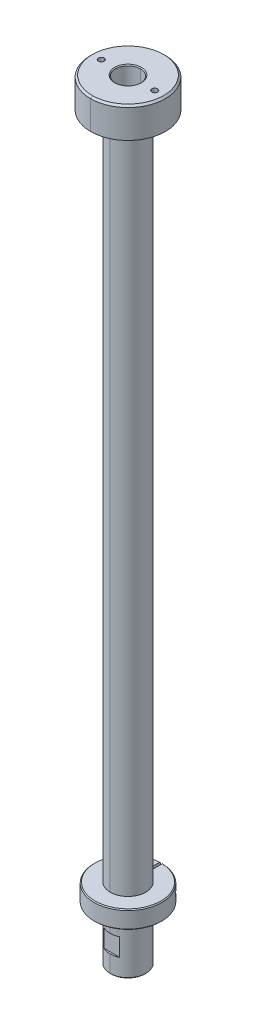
ISO-10303-21;
HEADER;
FILE_DESCRIPTION(('STEP AP214'),'2;1');
FILE_NAME('part.step','',(''),(''),'','','');
FILE_SCHEMA(('AUTOMOTIVE_DESIGN { 1 0 10303 214 1 1 1 1 }'));
ENDSEC;
DATA;
#1=APPLICATION_CONTEXT('core data for automotive mechanical design processes');
#2=APPLICATION_PROTOCOL_DEFINITION('international standard','automotive_design',2000,#1);
#3=PRODUCT_CONTEXT('',#1,'mechanical');
#4=PRODUCT('Part','Part','',(#3));
#5=PRODUCT_RELATED_PRODUCT_CATEGORY('part','',(#4));
#6=PRODUCT_DEFINITION_FORMATION('','',#4);
#7=PRODUCT_DEFINITION_CONTEXT('part definition',#1,'design');
#8=PRODUCT_DEFINITION('design','',#6,#7);
#9=PRODUCT_DEFINITION_SHAPE('','',#8);
#10=(LENGTH_UNIT() NAMED_UNIT(*) SI_UNIT(.MILLI.,.METRE.));
#11=(NAMED_UNIT(*) PLANE_ANGLE_UNIT() SI_UNIT($,.RADIAN.));
#12=(NAMED_UNIT(*) SI_UNIT($,.STERADIAN.) SOLID_ANGLE_UNIT());
#13=UNCERTAINTY_MEASURE_WITH_UNIT(LENGTH_MEASURE(1.E-05),#10,'distance_accuracy_value','');
#14=(GEOMETRIC_REPRESENTATION_CONTEXT(3) GLOBAL_UNCERTAINTY_ASSIGNED_CONTEXT((#13)) GLOBAL_UNIT_ASSIGNED_CONTEXT((#10,
#11,#12)) REPRESENTATION_CONTEXT('',''));
#15=CARTESIAN_POINT('',(0.,0.,0.));
#16=DIRECTION('',(0.,0.,1.));
#17=DIRECTION('',(1.,0.,0.));
#18=AXIS2_PLACEMENT_3D('',#15,#16,#17);
#19=CARTESIAN_POINT('',(0.,0.,0.));
#20=DIRECTION('',(0.,-1.,0.));
#21=DIRECTION('',(0.,0.,-1.));
#22=AXIS2_PLACEMENT_3D('',#19,#20,#21);
#23=CYLINDRICAL_SURFACE('',#22,10.);
#24=CARTESIAN_POINT('',(0.,30.,0.));
#25=DIRECTION('',(0.,1.,0.));
#26=DIRECTION('',(0.,0.,1.));
#27=AXIS2_PLACEMENT_3D('',#24,#25,#26);
#28=CIRCLE('',#27,10.);
#29=CARTESIAN_POINT('',(0.,30.,10.));
#30=VERTEX_POINT('',#29);
#31=CARTESIAN_POINT('',(0.75,30.,-9.97183533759));
#32=VERTEX_POINT('',#31);
#33=EDGE_CURVE('E40',#30,#32,#28,.T.);
#34=ORIENTED_EDGE('',*,*,#33,.F.);
#35=DIRECTION('',(0.,-1.,0.));
#36=VECTOR('',#35,1.);
#37=CARTESIAN_POINT('',(0.,30.,10.));
#38=LINE('',#37,#36);
#39=CARTESIAN_POINT('',(0.,20.,10.));
#40=VERTEX_POINT('',#39);
#41=EDGE_CURVE('E11',#30,#40,#38,.T.);
#42=ORIENTED_EDGE('',*,*,#41,.T.);
#43=CARTESIAN_POINT('',(0.,20.,0.));
#44=DIRECTION('',(0.,-1.,0.));
#45=DIRECTION('',(0.435889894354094,0.,0.899999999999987));
#46=AXIS2_PLACEMENT_3D('',#43,#44,#45);
#47=CIRCLE('',#46,10.);
#48=CARTESIAN_POINT('',(4.358898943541,20.,9.));
#49=VERTEX_POINT('',#48);
#50=EDGE_CURVE('E493',#49,#40,#47,.T.);
#51=ORIENTED_EDGE('',*,*,#50,.F.);
#52=DIRECTION('',(0.,-1.,0.));
#53=VECTOR('',#52,1.);
#54=CARTESIAN_POINT('',(4.358898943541,20.,9.));
#55=LINE('',#54,#53);
#56=CARTESIAN_POINT('',(4.358898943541,10.,9.));
#57=VERTEX_POINT('',#56);
#58=EDGE_CURVE('E27',#49,#57,#55,.T.);
#59=ORIENTED_EDGE('',*,*,#58,.T.);
#60=CARTESIAN_POINT('',(0.,10.,0.));
#61=DIRECTION('',(0.,1.,0.));
#62=DIRECTION('',(0.,0.,1.));
#63=AXIS2_PLACEMENT_3D('',#60,#61,#62);
#64=CIRCLE('',#63,10.);
#65=CARTESIAN_POINT('',(0.,10.,9.999999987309));
#66=VERTEX_POINT('',#65);
#67=EDGE_CURVE('E649',#66,#57,#64,.T.);
#68=ORIENTED_EDGE('',*,*,#67,.F.);
#69=DIRECTION('',(0.,-1.,1.335920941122E-09));
#70=VECTOR('',#69,1.);
#71=CARTESIAN_POINT('',(0.,10.,9.999999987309));
#72=LINE('',#71,#70);
#73=CARTESIAN_POINT('',(0.,0.5,10.));
#74=VERTEX_POINT('',#73);
#75=EDGE_CURVE('E563',#66,#74,#72,.T.);
#76=ORIENTED_EDGE('',*,*,#75,.T.);
#77=CARTESIAN_POINT('',(0.,0.5,0.));
#78=DIRECTION('',(0.,-1.,0.));
#79=DIRECTION('',(0.,0.,-1.));
#80=AXIS2_PLACEMENT_3D('',#77,#78,#79);
#81=CIRCLE('',#80,10.);
#82=CARTESIAN_POINT('',(0.,0.5,-10.));
#83=VERTEX_POINT('',#82);
#84=EDGE_CURVE('E629',#83,#74,#81,.T.);
#85=ORIENTED_EDGE('',*,*,#84,.F.);
#86=DIRECTION('',(0.,-1.,0.));
#87=VECTOR('',#86,1.);
#88=CARTESIAN_POINT('',(0.,10.,-10.));
#89=LINE('',#88,#87);
#90=CARTESIAN_POINT('',(0.,10.,-10.));
#91=VERTEX_POINT('',#90);
#92=EDGE_CURVE('E498',#91,#83,#89,.T.);
#93=ORIENTED_EDGE('',*,*,#92,.F.);
#94=CARTESIAN_POINT('',(0.,10.,0.));
#95=DIRECTION('',(0.,1.,0.));
#96=DIRECTION('',(0.435889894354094,0.,-0.899999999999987));
#97=AXIS2_PLACEMENT_3D('',#94,#95,#96);
#98=CIRCLE('',#97,10.);
#99=CARTESIAN_POINT('',(4.358898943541,10.,-9.));
#100=VERTEX_POINT('',#99);
#101=EDGE_CURVE('E569',#100,#91,#98,.T.);
#102=ORIENTED_EDGE('',*,*,#101,.F.);
#103=DIRECTION('',(0.,1.,0.));
#104=VECTOR('',#103,1.);
#105=CARTESIAN_POINT('',(4.358898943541,10.,-9.));
#106=LINE('',#105,#104);
#107=CARTESIAN_POINT('',(4.358898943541,20.,-9.));
#108=VERTEX_POINT('',#107);
#109=EDGE_CURVE('E611',#100,#108,#106,.T.);
#110=ORIENTED_EDGE('',*,*,#109,.T.);
#111=CARTESIAN_POINT('',(0.,20.,0.));
#112=DIRECTION('',(0.,-1.,0.));
#113=DIRECTION('',(0.,0.,-1.));
#114=AXIS2_PLACEMENT_3D('',#111,#112,#113);
#115=CIRCLE('',#114,10.);
#116=CARTESIAN_POINT('',(0.,20.,-9.999999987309));
#117=VERTEX_POINT('',#116);
#118=EDGE_CURVE('E171',#117,#108,#115,.T.);
#119=ORIENTED_EDGE('',*,*,#118,.F.);
#120=DIRECTION('',(0.,-1.,3.208910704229E-11));
#121=VECTOR('',#120,1.);
#122=CARTESIAN_POINT('',(0.,415.5,-10.));
#123=LINE('',#122,#121);
#124=CARTESIAN_POINT('',(0.,415.5,-10.));
#125=VERTEX_POINT('',#124);
#126=EDGE_CURVE('E559',#125,#117,#123,.T.);
#127=ORIENTED_EDGE('',*,*,#126,.F.);
#128=CARTESIAN_POINT('',(0.,415.5,0.));
#129=DIRECTION('',(0.,1.,0.));
#130=DIRECTION('',(0.,0.,1.));
#131=AXIS2_PLACEMENT_3D('',#128,#129,#130);
#132=CIRCLE('',#131,10.);
#133=CARTESIAN_POINT('',(0.,415.5,10.));
#134=VERTEX_POINT('',#133);
#135=EDGE_CURVE('E568',#134,#125,#132,.T.);
#136=ORIENTED_EDGE('',*,*,#135,.F.);
#137=DIRECTION('',(0.,-1.,0.));
#138=VECTOR('',#137,1.);
#139=CARTESIAN_POINT('',(0.,415.5,10.));
#140=LINE('',#139,#138);
#141=CARTESIAN_POINT('',(0.,40.,10.));
#142=VERTEX_POINT('',#141);
#143=EDGE_CURVE('E607',#134,#142,#140,.T.);
#144=ORIENTED_EDGE('',*,*,#143,.T.);
#145=CARTESIAN_POINT('',(0.,40.,0.));
#146=DIRECTION('',(0.,-1.,0.));
#147=DIRECTION('',(0.0749999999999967,0.,-0.997183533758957));
#148=AXIS2_PLACEMENT_3D('',#145,#146,#147);
#149=CIRCLE('',#148,10.);
#150=CARTESIAN_POINT('',(0.75,40.,-9.97183533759));
#151=VERTEX_POINT('',#150);
#152=EDGE_CURVE('E535',#151,#142,#149,.T.);
#153=ORIENTED_EDGE('',*,*,#152,.F.);
#154=DIRECTION('',(0.,-1.,0.));
#155=VECTOR('',#154,1.);
#156=CARTESIAN_POINT('',(0.75,40.,-9.97183533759));
#157=LINE('',#156,#155);
#158=EDGE_CURVE('E612',#151,#32,#157,.T.);
#159=ORIENTED_EDGE('',*,*,#158,.T.);
#160=EDGE_LOOP('',(#34,#42,#51,#59,#68,#76,#85,#93,#102,#110,#119,#127,#136,#144,#153,#159));
#161=FACE_BOUND('',#160,.T.);
#162=ADVANCED_FACE('F16',(#161),#23,.T.);
#163=CARTESIAN_POINT('',(0.75,380.,-9.97183533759));
#164=DIRECTION('',(-1.,0.,0.));
#165=DIRECTION('',(0.,0.,1.));
#166=AXIS2_PLACEMENT_3D('',#163,#164,#165);
#167=PLANE('',#166);
#168=DIRECTION('',(0.,0.,-1.));
#169=VECTOR('',#168,1.);
#170=CARTESIAN_POINT('',(0.75,40.,-9.97183533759));
#171=LINE('',#170,#169);
#172=CARTESIAN_POINT('',(0.75,40.,-18.48479104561));
#173=VERTEX_POINT('',#172);
#174=EDGE_CURVE('E471',#151,#173,#171,.T.);
#175=ORIENTED_EDGE('',*,*,#174,.T.);
#176=CARTESIAN_POINT('',(0.75,39.5,-18.98519159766));
#177=CARTESIAN_POINT('',(0.75,39.55555594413,-18.92959232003));
#178=CARTESIAN_POINT('',(0.75,39.66666758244,-18.81839325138));
#179=CARTESIAN_POINT('',(0.75,39.83333426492,-18.65159308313));
#180=CARTESIAN_POINT('',(0.75,39.94444484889,-18.5403919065));
#181=CARTESIAN_POINT('',(0.75,40.,-18.48479104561));
#182=(BOUNDED_CURVE() B_SPLINE_CURVE(3,(#176,#177,#178,#179,#180,#181),.UNSPECIFIED.,.F.,
.F.) B_SPLINE_CURVE_WITH_KNOTS((4,1,1,4),(0.,0.3333333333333,0.6666666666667,1.),
.UNSPECIFIED.) CURVE() GEOMETRIC_REPRESENTATION_ITEM() RATIONAL_B_SPLINE_CURVE((1.,1.,1.,1.,1.,1.)) REPRESENTATION_ITEM(''));
#183=CARTESIAN_POINT('',(0.75,39.5,-18.98519159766));
#184=VERTEX_POINT('',#183);
#185=EDGE_CURVE('E376',#184,#173,#182,.T.);
#186=ORIENTED_EDGE('',*,*,#185,.F.);
#187=DIRECTION('',(0.,1.,0.));
#188=VECTOR('',#187,1.);
#189=CARTESIAN_POINT('',(0.75,30.5,-18.98519159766));
#190=LINE('',#189,#188);
#191=CARTESIAN_POINT('',(0.75,30.5,-18.98519159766));
#192=VERTEX_POINT('',#191);
#193=EDGE_CURVE('E365',#192,#184,#190,.T.);
#194=ORIENTED_EDGE('',*,*,#193,.F.);
#195=CARTESIAN_POINT('',(0.75,30.,-18.48479104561));
#196=CARTESIAN_POINT('',(0.75,30.05555515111,-18.54039190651));
#197=CARTESIAN_POINT('',(0.75,30.16666573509,-18.65159308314));
#198=CARTESIAN_POINT('',(0.75,30.33333241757,-18.81839325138));
#199=CARTESIAN_POINT('',(0.75,30.44444405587,-18.92959232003));
#200=CARTESIAN_POINT('',(0.75,30.5,-18.98519159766));
#201=(BOUNDED_CURVE() B_SPLINE_CURVE(3,(#195,#196,#197,#198,#199,#200),.UNSPECIFIED.,.F.,
.F.) B_SPLINE_CURVE_WITH_KNOTS((4,1,1,4),(0.,0.3333333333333,0.6666666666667,1.),
.UNSPECIFIED.) CURVE() GEOMETRIC_REPRESENTATION_ITEM() RATIONAL_B_SPLINE_CURVE((1.,1.,1.,1.,1.,1.)) REPRESENTATION_ITEM(''));
#202=CARTESIAN_POINT('',(0.75,30.,-18.48479104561));
#203=VERTEX_POINT('',#202);
#204=EDGE_CURVE('E635',#203,#192,#201,.T.);
#205=ORIENTED_EDGE('',*,*,#204,.F.);
#206=DIRECTION('',(0.,0.,1.));
#207=VECTOR('',#206,1.);
#208=CARTESIAN_POINT('',(0.75,30.,-18.48479104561));
#209=LINE('',#208,#207);
#210=EDGE_CURVE('E401',#203,#32,#209,.T.);
#211=ORIENTED_EDGE('',*,*,#210,.T.);
#212=ORIENTED_EDGE('',*,*,#158,.F.);
#213=EDGE_LOOP('',(#175,#186,#194,#205,#211,#212));
#214=FACE_BOUND('',#213,.T.);
#215=CARTESIAN_POINT('',(0.75,35.,-13.5));
#216=DIRECTION('',(1.,0.,0.));
#217=DIRECTION('',(0.,0.,-1.));
#218=AXIS2_PLACEMENT_3D('',#215,#216,#217);
#219=CIRCLE('',#218,2.);
#220=CARTESIAN_POINT('',(0.75,35.,-15.5));
#221=VERTEX_POINT('',#220);
#222=CARTESIAN_POINT('',(0.75,35.,-11.5));
#223=VERTEX_POINT('',#222);
#224=EDGE_CURVE('E397',#221,#223,#219,.T.);
#225=ORIENTED_EDGE('',*,*,#224,.T.);
#226=CARTESIAN_POINT('',(0.75,35.,-13.5));
#227=DIRECTION('',(1.,0.,0.));
#228=DIRECTION('',(0.,0.,1.));
#229=AXIS2_PLACEMENT_3D('',#226,#227,#228);
#230=CIRCLE('',#229,2.);
#231=EDGE_CURVE('E402',#223,#221,#230,.T.);
#232=ORIENTED_EDGE('',*,*,#231,.T.);
#233=EDGE_LOOP('',(#225,#232));
#234=FACE_BOUND('',#233,.T.);
#235=ADVANCED_FACE('F1692',(#214,#234),#167,.T.);
#236=CARTESIAN_POINT('',(9.5,35.,-13.5));
#237=DIRECTION('',(1.,0.,0.));
#238=DIRECTION('',(0.,0.,-1.));
#239=AXIS2_PLACEMENT_3D('',#236,#237,#238);
#240=CYLINDRICAL_SURFACE('',#239,2.);
#241=DIRECTION('',(1.,0.,0.));
#242=VECTOR('',#241,1.);
#243=CARTESIAN_POINT('',(-0.75,35.,-11.5));
#244=LINE('',#243,#242);
#245=CARTESIAN_POINT('',(-0.75,35.,-11.5));
#246=VERTEX_POINT('',#245);
#247=EDGE_CURVE('E605',#246,#223,#244,.T.);
#248=ORIENTED_EDGE('',*,*,#247,.F.);
#249=CARTESIAN_POINT('',(-0.75,35.,-13.5));
#250=DIRECTION('',(-1.,0.,0.));
#251=DIRECTION('',(0.,0.,-1.));
#252=AXIS2_PLACEMENT_3D('',#249,#250,#251);
#253=CIRCLE('',#252,2.);
#254=CARTESIAN_POINT('',(-0.75,35.,-15.5));
#255=VERTEX_POINT('',#254);
#256=EDGE_CURVE('E641',#255,#246,#253,.T.);
#257=ORIENTED_EDGE('',*,*,#256,.F.);
#258=DIRECTION('',(1.,0.,0.));
#259=VECTOR('',#258,1.);
#260=CARTESIAN_POINT('',(-0.75,35.,-15.5));
#261=LINE('',#260,#259);
#262=EDGE_CURVE('E628',#255,#221,#261,.T.);
#263=ORIENTED_EDGE('',*,*,#262,.T.);
#264=ORIENTED_EDGE('',*,*,#231,.F.);
#265=EDGE_LOOP('',(#248,#257,#263,#264));
#266=FACE_BOUND('',#265,.T.);
#267=ADVANCED_FACE('F1686',(#266),#240,.T.);
#268=CARTESIAN_POINT('',(9.5,35.,-13.5));
#269=DIRECTION('',(1.,0.,0.));
#270=DIRECTION('',(0.,0.,-1.));
#271=AXIS2_PLACEMENT_3D('',#268,#269,#270);
#272=CYLINDRICAL_SURFACE('',#271,2.);
#273=ORIENTED_EDGE('',*,*,#262,.F.);
#274=CARTESIAN_POINT('',(-0.75,35.,-13.5));
#275=DIRECTION('',(-1.,0.,0.));
#276=DIRECTION('',(0.,0.,1.));
#277=AXIS2_PLACEMENT_3D('',#274,#275,#276);
#278=CIRCLE('',#277,2.);
#279=EDGE_CURVE('E723',#246,#255,#278,.T.);
#280=ORIENTED_EDGE('',*,*,#279,.F.);
#281=ORIENTED_EDGE('',*,*,#247,.T.);
#282=ORIENTED_EDGE('',*,*,#224,.F.);
#283=EDGE_LOOP('',(#273,#280,#281,#282));
#284=FACE_BOUND('',#283,.T.);
#285=ADVANCED_FACE('F1691',(#284),#272,.T.);
#286=CARTESIAN_POINT('',(-0.75,380.,-20.));
#287=DIRECTION('',(1.,0.,0.));
#288=DIRECTION('',(0.,1.,0.));
#289=AXIS2_PLACEMENT_3D('',#286,#287,#288);
#290=PLANE('',#289);
#291=DIRECTION('',(0.,-1.,0.));
#292=VECTOR('',#291,1.);
#293=CARTESIAN_POINT('',(-0.75,39.5,-18.98519159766));
#294=LINE('',#293,#292);
#295=CARTESIAN_POINT('',(-0.75,39.5,-18.98519159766));
#296=VERTEX_POINT('',#295);
#297=CARTESIAN_POINT('',(-0.75,30.5,-18.98519159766));
#298=VERTEX_POINT('',#297);
#299=EDGE_CURVE('E350',#296,#298,#294,.T.);
#300=ORIENTED_EDGE('',*,*,#299,.F.);
#301=CARTESIAN_POINT('',(-0.75,40.,-18.48479104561));
#302=CARTESIAN_POINT('',(-0.75,39.94444484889,-18.5403919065));
#303=CARTESIAN_POINT('',(-0.75,39.83333426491,-18.65159308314));
#304=CARTESIAN_POINT('',(-0.75,39.66666758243,-18.81839325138));
#305=CARTESIAN_POINT('',(-0.75,39.55555594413,-18.92959232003));
#306=CARTESIAN_POINT('',(-0.75,39.5,-18.98519159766));
#307=(BOUNDED_CURVE() B_SPLINE_CURVE(3,(#301,#302,#303,#304,#305,#306),.UNSPECIFIED.,.F.,
.F.) B_SPLINE_CURVE_WITH_KNOTS((4,1,1,4),(0.,0.3333333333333,0.6666666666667,1.),
.UNSPECIFIED.) CURVE() GEOMETRIC_REPRESENTATION_ITEM() RATIONAL_B_SPLINE_CURVE((1.,1.,1.,1.,1.,1.)) REPRESENTATION_ITEM(''));
#308=CARTESIAN_POINT('',(-0.75,40.,-18.48479104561));
#309=VERTEX_POINT('',#308);
#310=EDGE_CURVE('E355',#309,#296,#307,.T.);
#311=ORIENTED_EDGE('',*,*,#310,.F.);
#312=DIRECTION('',(0.,0.,1.));
#313=VECTOR('',#312,1.);
#314=CARTESIAN_POINT('',(-0.75,40.,-18.48479104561));
#315=LINE('',#314,#313);
#316=CARTESIAN_POINT('',(-0.75,40.,-9.97183533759));
#317=VERTEX_POINT('',#316);
#318=EDGE_CURVE('E602',#309,#317,#315,.T.);
#319=ORIENTED_EDGE('',*,*,#318,.T.);
#320=DIRECTION('',(0.,1.,0.));
#321=VECTOR('',#320,1.);
#322=CARTESIAN_POINT('',(-0.75,30.,-9.97183533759));
#323=LINE('',#322,#321);
#324=CARTESIAN_POINT('',(-0.75,30.,-9.97183533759));
#325=VERTEX_POINT('',#324);
#326=EDGE_CURVE('E734',#325,#317,#323,.T.);
#327=ORIENTED_EDGE('',*,*,#326,.F.);
#328=DIRECTION('',(0.,0.,-1.));
#329=VECTOR('',#328,1.);
#330=CARTESIAN_POINT('',(-0.75,30.,-9.97183533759));
#331=LINE('',#330,#329);
#332=CARTESIAN_POINT('',(-0.75,30.,-18.48479104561));
#333=VERTEX_POINT('',#332);
#334=EDGE_CURVE('E606',#325,#333,#331,.T.);
#335=ORIENTED_EDGE('',*,*,#334,.T.);
#336=CARTESIAN_POINT('',(-0.75,30.5,-18.98519159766));
#337=CARTESIAN_POINT('',(-0.75,30.44444405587,-18.92959232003));
#338=CARTESIAN_POINT('',(-0.75,30.33333241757,-18.81839325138));
#339=CARTESIAN_POINT('',(-0.75,30.16666573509,-18.65159308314));
#340=CARTESIAN_POINT('',(-0.75,30.05555515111,-18.54039190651));
#341=CARTESIAN_POINT('',(-0.75,30.,-18.48479104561));
#342=(BOUNDED_CURVE() B_SPLINE_CURVE(3,(#336,#337,#338,#339,#340,#341),.UNSPECIFIED.,.F.,
.F.) B_SPLINE_CURVE_WITH_KNOTS((4,1,1,4),(0.,0.3333333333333,0.6666666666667,1.),
.UNSPECIFIED.) CURVE() GEOMETRIC_REPRESENTATION_ITEM() RATIONAL_B_SPLINE_CURVE((1.,1.,1.,1.,1.,1.)) REPRESENTATION_ITEM(''));
#343=EDGE_CURVE('E358',#298,#333,#342,.T.);
#344=ORIENTED_EDGE('',*,*,#343,.F.);
#345=EDGE_LOOP('',(#300,#311,#319,#327,#335,#344));
#346=FACE_BOUND('',#345,.T.);
#347=ORIENTED_EDGE('',*,*,#279,.T.);
#348=ORIENTED_EDGE('',*,*,#256,.T.);
#349=EDGE_LOOP('',(#347,#348));
#350=FACE_BOUND('',#349,.T.);
#351=ADVANCED_FACE('F352',(#346,#350),#290,.T.);
#352=CARTESIAN_POINT('',(0.,30.25,0.));
#353=DIRECTION('',(0.,1.,0.));
#354=DIRECTION('',(0.,0.,1.));
#355=AXIS2_PLACEMENT_3D('',#352,#353,#354);
#356=CONICAL_SURFACE('',#355,18.75,0.7853981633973);
#357=CARTESIAN_POINT('',(0.,30.,0.));
#358=DIRECTION('',(0.,-1.,0.));
#359=DIRECTION('',(0.0405405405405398,0.,-0.999177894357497));
#360=AXIS2_PLACEMENT_3D('',#357,#358,#359);
#361=CIRCLE('',#360,18.5);
#362=CARTESIAN_POINT('',(1.011413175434E-13,30.,18.5));
#363=VERTEX_POINT('',#362);
#364=EDGE_CURVE('E539',#203,#363,#361,.T.);
#365=ORIENTED_EDGE('',*,*,#364,.F.);
#366=ORIENTED_EDGE('',*,*,#204,.T.);
#367=CARTESIAN_POINT('',(0.,30.5,0.));
#368=DIRECTION('',(0.,-1.,0.));
#369=DIRECTION('',(0.0394736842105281,0.,-0.999220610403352));
#370=AXIS2_PLACEMENT_3D('',#367,#368,#369);
#371=CIRCLE('',#370,19.);
#372=CARTESIAN_POINT('',(0.,30.5,19.));
#373=VERTEX_POINT('',#372);
#374=EDGE_CURVE('E418',#192,#373,#371,.T.);
#375=ORIENTED_EDGE('',*,*,#374,.T.);
#376=CARTESIAN_POINT('',(0.,30.5,0.));
#377=DIRECTION('',(0.,-1.,0.));
#378=DIRECTION('',(0.,0.,1.));
#379=AXIS2_PLACEMENT_3D('',#376,#377,#378);
#380=CIRCLE('',#379,19.);
#381=EDGE_CURVE('E415',#373,#298,#380,.T.);
#382=ORIENTED_EDGE('',*,*,#381,.T.);
#383=ORIENTED_EDGE('',*,*,#343,.T.);
#384=CARTESIAN_POINT('',(0.,30.,0.));
#385=DIRECTION('',(0.,-1.,0.));
#386=DIRECTION('',(0.,0.,1.));
#387=AXIS2_PLACEMENT_3D('',#384,#385,#386);
#388=CIRCLE('',#387,18.5);
#389=EDGE_CURVE('E543',#363,#333,#388,.T.);
#390=ORIENTED_EDGE('',*,*,#389,.F.);
#391=EDGE_LOOP('',(#365,#366,#375,#382,#383,#390));
#392=FACE_BOUND('',#391,.T.);
#393=ADVANCED_FACE('F1610',(#392),#356,.T.);
#394=CARTESIAN_POINT('',(10.,30.,0.));
#395=DIRECTION('',(0.,-1.,0.));
#396=DIRECTION('',(0.,0.,-1.));
#397=AXIS2_PLACEMENT_3D('',#394,#395,#396);
#398=PLANE('',#397);
#399=ORIENTED_EDGE('',*,*,#33,.T.);
#400=ORIENTED_EDGE('',*,*,#210,.F.);
#401=ORIENTED_EDGE('',*,*,#364,.T.);
#402=ORIENTED_EDGE('',*,*,#389,.T.);
#403=ORIENTED_EDGE('',*,*,#334,.F.);
#404=CARTESIAN_POINT('',(0.,30.,0.));
#405=DIRECTION('',(0.,1.,0.));
#406=DIRECTION('',(-0.0749999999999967,0.,-0.997183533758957));
#407=AXIS2_PLACEMENT_3D('',#404,#405,#406);
#408=CIRCLE('',#407,10.);
#409=EDGE_CURVE('E737',#325,#30,#408,.T.);
#410=ORIENTED_EDGE('',*,*,#409,.T.);
#411=EDGE_LOOP('',(#399,#400,#401,#402,#403,#410));
#412=FACE_BOUND('',#411,.T.);
#413=ADVANCED_FACE('F1616',(#412),#398,.T.);
#414=CARTESIAN_POINT('',(0.,0.,0.));
#415=DIRECTION('',(0.,-1.,0.));
#416=DIRECTION('',(0.,0.,-1.));
#417=AXIS2_PLACEMENT_3D('',#414,#415,#416);
#418=CYLINDRICAL_SURFACE('',#417,10.);
#419=ORIENTED_EDGE('',*,*,#326,.T.);
#420=CARTESIAN_POINT('',(0.,40.,0.));
#421=DIRECTION('',(0.,-1.,0.));
#422=DIRECTION('',(0.,0.,1.));
#423=AXIS2_PLACEMENT_3D('',#420,#421,#422);
#424=CIRCLE('',#423,10.);
#425=EDGE_CURVE('E463',#142,#317,#424,.T.);
#426=ORIENTED_EDGE('',*,*,#425,.F.);
#427=ORIENTED_EDGE('',*,*,#143,.F.);
#428=CARTESIAN_POINT('',(0.,415.5,0.));
#429=DIRECTION('',(0.,1.,0.));
#430=DIRECTION('',(0.,0.,-1.));
#431=AXIS2_PLACEMENT_3D('',#428,#429,#430);
#432=CIRCLE('',#431,10.);
#433=EDGE_CURVE('E564',#125,#134,#432,.T.);
#434=ORIENTED_EDGE('',*,*,#433,.F.);
#435=ORIENTED_EDGE('',*,*,#126,.T.);
#436=CARTESIAN_POINT('',(0.,20.,0.));
#437=DIRECTION('',(0.,-1.,0.));
#438=DIRECTION('',(-0.435889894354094,0.,-0.899999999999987));
#439=AXIS2_PLACEMENT_3D('',#436,#437,#438);
#440=CIRCLE('',#439,10.);
#441=CARTESIAN_POINT('',(-4.358898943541,20.,-9.));
#442=VERTEX_POINT('',#441);
#443=EDGE_CURVE('E523',#442,#117,#440,.T.);
#444=ORIENTED_EDGE('',*,*,#443,.F.);
#445=DIRECTION('',(0.,-1.,0.));
#446=VECTOR('',#445,1.);
#447=CARTESIAN_POINT('',(-4.358898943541,20.,-9.));
#448=LINE('',#447,#446);
#449=CARTESIAN_POINT('',(-4.358898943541,10.,-9.));
#450=VERTEX_POINT('',#449);
#451=EDGE_CURVE('E502',#442,#450,#448,.T.);
#452=ORIENTED_EDGE('',*,*,#451,.T.);
#453=CARTESIAN_POINT('',(0.,10.,0.));
#454=DIRECTION('',(0.,1.,0.));
#455=DIRECTION('',(0.,0.,-1.));
#456=AXIS2_PLACEMENT_3D('',#453,#454,#455);
#457=CIRCLE('',#456,10.);
#458=EDGE_CURVE('E727',#91,#450,#457,.T.);
#459=ORIENTED_EDGE('',*,*,#458,.F.);
#460=ORIENTED_EDGE('',*,*,#92,.T.);
#461=CARTESIAN_POINT('',(0.,0.5,0.));
#462=DIRECTION('',(0.,-1.,0.));
#463=DIRECTION('',(0.,0.,1.));
#464=AXIS2_PLACEMENT_3D('',#461,#462,#463);
#465=CIRCLE('',#464,10.);
#466=EDGE_CURVE('E650',#74,#83,#465,.T.);
#467=ORIENTED_EDGE('',*,*,#466,.F.);
#468=ORIENTED_EDGE('',*,*,#75,.F.);
#469=CARTESIAN_POINT('',(0.,10.,0.));
#470=DIRECTION('',(0.,1.,0.));
#471=DIRECTION('',(-0.435889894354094,0.,0.899999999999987));
#472=AXIS2_PLACEMENT_3D('',#469,#470,#471);
#473=CIRCLE('',#472,10.);
#474=CARTESIAN_POINT('',(-4.358898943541,10.,9.));
#475=VERTEX_POINT('',#474);
#476=EDGE_CURVE('E430',#475,#66,#473,.T.);
#477=ORIENTED_EDGE('',*,*,#476,.F.);
#478=DIRECTION('',(0.,1.,0.));
#479=VECTOR('',#478,1.);
#480=CARTESIAN_POINT('',(-4.358898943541,10.,9.));
#481=LINE('',#480,#479);
#482=CARTESIAN_POINT('',(-4.358898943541,20.,9.));
#483=VERTEX_POINT('',#482);
#484=EDGE_CURVE('E496',#475,#483,#481,.T.);
#485=ORIENTED_EDGE('',*,*,#484,.T.);
#486=CARTESIAN_POINT('',(0.,20.,0.));
#487=DIRECTION('',(0.,-1.,0.));
#488=DIRECTION('',(0.,0.,1.));
#489=AXIS2_PLACEMENT_3D('',#486,#487,#488);
#490=CIRCLE('',#489,10.);
#491=EDGE_CURVE('E497',#40,#483,#490,.T.);
#492=ORIENTED_EDGE('',*,*,#491,.F.);
#493=ORIENTED_EDGE('',*,*,#41,.F.);
#494=ORIENTED_EDGE('',*,*,#409,.F.);
#495=EDGE_LOOP('',(#419,#426,#427,#434,#435,#444,#452,#459,#460,#467,#468,#477,#485,#492,#493,#494));
#496=FACE_BOUND('',#495,.T.);
#497=ADVANCED_FACE('F1633',(#496),#418,.T.);
#498=CARTESIAN_POINT('',(10.,20.,9.));
#499=DIRECTION('',(0.,-1.,0.));
#500=DIRECTION('',(0.,0.,-1.));
#501=AXIS2_PLACEMENT_3D('',#498,#499,#500);
#502=PLANE('',#501);
#503=ORIENTED_EDGE('',*,*,#50,.T.);
#504=ORIENTED_EDGE('',*,*,#491,.T.);
#505=DIRECTION('',(1.,0.,0.));
#506=VECTOR('',#505,1.);
#507=CARTESIAN_POINT('',(-4.358898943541,20.,9.));
#508=LINE('',#507,#506);
#509=EDGE_CURVE('E429',#483,#49,#508,.T.);
#510=ORIENTED_EDGE('',*,*,#509,.T.);
#511=EDGE_LOOP('',(#503,#504,#510));
#512=FACE_BOUND('',#511,.T.);
#513=ADVANCED_FACE('F1627',(#512),#502,.T.);
#514=CARTESIAN_POINT('',(10.,10.,9.));
#515=DIRECTION('',(0.,0.,1.));
#516=DIRECTION('',(1.,0.,0.));
#517=AXIS2_PLACEMENT_3D('',#514,#515,#516);
#518=PLANE('',#517);
#519=ORIENTED_EDGE('',*,*,#58,.F.);
#520=ORIENTED_EDGE('',*,*,#509,.F.);
#521=ORIENTED_EDGE('',*,*,#484,.F.);
#522=DIRECTION('',(1.,0.,0.));
#523=VECTOR('',#522,1.);
#524=CARTESIAN_POINT('',(-4.358898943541,10.,9.));
#525=LINE('',#524,#523);
#526=EDGE_CURVE('E425',#475,#57,#525,.T.);
#527=ORIENTED_EDGE('',*,*,#526,.T.);
#528=EDGE_LOOP('',(#519,#520,#521,#527));
#529=FACE_BOUND('',#528,.T.);
#530=ADVANCED_FACE('F1632',(#529),#518,.T.);
#531=CARTESIAN_POINT('',(10.,10.,14.));
#532=DIRECTION('',(0.,1.,0.));
#533=DIRECTION('',(1.,0.,0.));
#534=AXIS2_PLACEMENT_3D('',#531,#532,#533);
#535=PLANE('',#534);
#536=ORIENTED_EDGE('',*,*,#526,.F.);
#537=ORIENTED_EDGE('',*,*,#476,.T.);
#538=ORIENTED_EDGE('',*,*,#67,.T.);
#539=EDGE_LOOP('',(#536,#537,#538));
#540=FACE_BOUND('',#539,.T.);
#541=ADVANCED_FACE('F1744',(#540),#535,.T.);
#542=CARTESIAN_POINT('',(0.,0.25,0.));
#543=DIRECTION('',(0.,1.,0.));
#544=DIRECTION('',(0.,0.,1.));
#545=AXIS2_PLACEMENT_3D('',#542,#543,#544);
#546=CONICAL_SURFACE('',#545,9.75,0.7853981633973);
#547=DIRECTION('',(0.,0.707106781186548,-0.707106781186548));
#548=VECTOR('',#547,1.);
#549=CARTESIAN_POINT('',(0.,0.,-9.5));
#550=LINE('',#549,#548);
#551=CARTESIAN_POINT('',(0.,0.,-9.5));
#552=VERTEX_POINT('',#551);
#553=EDGE_CURVE('E633',#552,#83,#550,.T.);
#554=ORIENTED_EDGE('',*,*,#553,.F.);
#555=CARTESIAN_POINT('',(0.,0.,0.));
#556=DIRECTION('',(0.,-1.,0.));
#557=DIRECTION('',(0.,0.,1.));
#558=AXIS2_PLACEMENT_3D('',#555,#556,#557);
#559=CIRCLE('',#558,9.5);
#560=CARTESIAN_POINT('',(0.,0.,9.5));
#561=VERTEX_POINT('',#560);
#562=EDGE_CURVE('E634',#561,#552,#559,.T.);
#563=ORIENTED_EDGE('',*,*,#562,.F.);
#564=DIRECTION('',(0.,0.707106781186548,0.707106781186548));
#565=VECTOR('',#564,1.);
#566=CARTESIAN_POINT('',(0.,0.,9.5));
#567=LINE('',#566,#565);
#568=EDGE_CURVE('E642',#561,#74,#567,.T.);
#569=ORIENTED_EDGE('',*,*,#568,.T.);
#570=ORIENTED_EDGE('',*,*,#466,.T.);
#571=EDGE_LOOP('',(#554,#563,#569,#570));
#572=FACE_BOUND('',#571,.T.);
#573=ADVANCED_FACE('F1809',(#572),#546,.T.);
#574=CARTESIAN_POINT('',(0.,0.25,0.));
#575=DIRECTION('',(0.,1.,0.));
#576=DIRECTION('',(0.,0.,1.));
#577=AXIS2_PLACEMENT_3D('',#574,#575,#576);
#578=CONICAL_SURFACE('',#577,9.75,0.7853981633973);
#579=ORIENTED_EDGE('',*,*,#568,.F.);
#580=CARTESIAN_POINT('',(0.,0.,0.));
#581=DIRECTION('',(0.,-1.,0.));
#582=DIRECTION('',(0.,0.,-1.));
#583=AXIS2_PLACEMENT_3D('',#580,#581,#582);
#584=CIRCLE('',#583,9.5);
#585=EDGE_CURVE('E793',#552,#561,#584,.T.);
#586=ORIENTED_EDGE('',*,*,#585,.F.);
#587=ORIENTED_EDGE('',*,*,#553,.T.);
#588=ORIENTED_EDGE('',*,*,#84,.T.);
#589=EDGE_LOOP('',(#579,#586,#587,#588));
#590=FACE_BOUND('',#589,.T.);
#591=ADVANCED_FACE('F1676',(#590),#578,.T.);
#592=CARTESIAN_POINT('',(7.,0.,0.));
#593=DIRECTION('',(0.,-1.,0.));
#594=DIRECTION('',(0.,0.,-1.));
#595=AXIS2_PLACEMENT_3D('',#592,#593,#594);
#596=PLANE('',#595);
#597=ORIENTED_EDGE('',*,*,#562,.T.);
#598=ORIENTED_EDGE('',*,*,#585,.T.);
#599=EDGE_LOOP('',(#597,#598));
#600=FACE_BOUND('',#599,.T.);
#601=CARTESIAN_POINT('',(0.,0.,0.));
#602=DIRECTION('',(0.,1.,0.));
#603=DIRECTION('',(0.,0.,1.));
#604=AXIS2_PLACEMENT_3D('',#601,#602,#603);
#605=CIRCLE('',#604,7.);
#606=CARTESIAN_POINT('',(0.,0.,7.));
#607=VERTEX_POINT('',#606);
#608=CARTESIAN_POINT('',(0.,0.,-7.));
#609=VERTEX_POINT('',#608);
#610=EDGE_CURVE('E616',#607,#609,#605,.T.);
#611=ORIENTED_EDGE('',*,*,#610,.T.);
#612=CARTESIAN_POINT('',(0.,0.,0.));
#613=DIRECTION('',(0.,1.,0.));
#614=DIRECTION('',(0.,0.,-1.));
#615=AXIS2_PLACEMENT_3D('',#612,#613,#614);
#616=CIRCLE('',#615,7.);
#617=EDGE_CURVE('E613',#609,#607,#616,.T.);
#618=ORIENTED_EDGE('',*,*,#617,.T.);
#619=EDGE_LOOP('',(#611,#618));
#620=FACE_BOUND('',#619,.T.);
#621=ADVANCED_FACE('F1670',(#600,#620),#596,.T.);
#622=CARTESIAN_POINT('',(0.,0.,0.));
#623=DIRECTION('',(0.,-1.,0.));
#624=DIRECTION('',(0.,0.,-1.));
#625=AXIS2_PLACEMENT_3D('',#622,#623,#624);
#626=CYLINDRICAL_SURFACE('',#625,7.);
#627=DIRECTION('',(0.,-1.,0.));
#628=VECTOR('',#627,1.);
#629=CARTESIAN_POINT('',(0.,432.,-7.));
#630=LINE('',#629,#628);
#631=CARTESIAN_POINT('',(0.,432.,-7.));
#632=VERTEX_POINT('',#631);
#633=EDGE_CURVE('E654',#632,#609,#630,.T.);
#634=ORIENTED_EDGE('',*,*,#633,.F.);
#635=CARTESIAN_POINT('',(0.,432.,0.));
#636=DIRECTION('',(0.,-1.,0.));
#637=DIRECTION('',(0.,0.,1.));
#638=AXIS2_PLACEMENT_3D('',#635,#636,#637);
#639=CIRCLE('',#638,7.);
#640=CARTESIAN_POINT('',(0.,432.,7.));
#641=VERTEX_POINT('',#640);
#642=EDGE_CURVE('E396',#641,#632,#639,.T.);
#643=ORIENTED_EDGE('',*,*,#642,.F.);
#644=DIRECTION('',(0.,-1.,0.));
#645=VECTOR('',#644,1.);
#646=CARTESIAN_POINT('',(0.,432.,7.));
#647=LINE('',#646,#645);
#648=EDGE_CURVE('E617',#641,#607,#647,.T.);
#649=ORIENTED_EDGE('',*,*,#648,.T.);
#650=ORIENTED_EDGE('',*,*,#617,.F.);
#651=EDGE_LOOP('',(#634,#643,#649,#650));
#652=FACE_BOUND('',#651,.T.);
#653=ADVANCED_FACE('F1675',(#652),#626,.F.);
#654=CARTESIAN_POINT('',(0.,0.,0.));
#655=DIRECTION('',(0.,-1.,0.));
#656=DIRECTION('',(0.,0.,-1.));
#657=AXIS2_PLACEMENT_3D('',#654,#655,#656);
#658=CYLINDRICAL_SURFACE('',#657,7.);
#659=ORIENTED_EDGE('',*,*,#648,.F.);
#660=CARTESIAN_POINT('',(0.,432.,0.));
#661=DIRECTION('',(0.,-1.,0.));
#662=DIRECTION('',(0.,0.,-1.));
#663=AXIS2_PLACEMENT_3D('',#660,#661,#662);
#664=CIRCLE('',#663,7.);
#665=EDGE_CURVE('E395',#632,#641,#664,.T.);
#666=ORIENTED_EDGE('',*,*,#665,.F.);
#667=ORIENTED_EDGE('',*,*,#633,.T.);
#668=ORIENTED_EDGE('',*,*,#610,.F.);
#669=EDGE_LOOP('',(#659,#666,#667,#668));
#670=FACE_BOUND('',#669,.T.);
#671=ADVANCED_FACE('F2054',(#670),#658,.F.);
#672=CARTESIAN_POINT('',(0.,432.25,0.));
#673=DIRECTION('',(0.,1.,0.));
#674=DIRECTION('',(0.,0.,1.));
#675=AXIS2_PLACEMENT_3D('',#672,#673,#674);
#676=CONICAL_SURFACE('',#675,7.25,0.7853981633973);
#677=DIRECTION('',(0.,0.707106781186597,0.707106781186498));
#678=VECTOR('',#677,1.);
#679=CARTESIAN_POINT('',(0.,432.,7.));
#680=LINE('',#679,#678);
#681=CARTESIAN_POINT('',(0.,432.5,7.5));
#682=VERTEX_POINT('',#681);
#683=EDGE_CURVE('E551',#641,#682,#680,.T.);
#684=ORIENTED_EDGE('',*,*,#683,.T.);
#685=CARTESIAN_POINT('',(0.,432.5,0.));
#686=DIRECTION('',(0.,-1.,0.));
#687=DIRECTION('',(0.,0.,-1.));
#688=AXIS2_PLACEMENT_3D('',#685,#686,#687);
#689=CIRCLE('',#688,7.5);
#690=CARTESIAN_POINT('',(0.,432.5,-7.5));
#691=VERTEX_POINT('',#690);
#692=EDGE_CURVE('E581',#691,#682,#689,.T.);
#693=ORIENTED_EDGE('',*,*,#692,.F.);
#694=DIRECTION('',(0.,0.707106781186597,-0.707106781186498));
#695=VECTOR('',#694,1.);
#696=CARTESIAN_POINT('',(0.,432.,-7.));
#697=LINE('',#696,#695);
#698=EDGE_CURVE('E392',#632,#691,#697,.T.);
#699=ORIENTED_EDGE('',*,*,#698,.F.);
#700=ORIENTED_EDGE('',*,*,#665,.T.);
#701=EDGE_LOOP('',(#684,#693,#699,#700));
#702=FACE_BOUND('',#701,.T.);
#703=ADVANCED_FACE('F945',(#702),#676,.F.);
#704=CARTESIAN_POINT('',(0.,432.25,0.));
#705=DIRECTION('',(0.,1.,0.));
#706=DIRECTION('',(0.,0.,1.));
#707=AXIS2_PLACEMENT_3D('',#704,#705,#706);
#708=CONICAL_SURFACE('',#707,7.25,0.7853981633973);
#709=ORIENTED_EDGE('',*,*,#698,.T.);
#710=CARTESIAN_POINT('',(0.,432.5,0.));
#711=DIRECTION('',(0.,-1.,0.));
#712=DIRECTION('',(0.,0.,1.));
#713=AXIS2_PLACEMENT_3D('',#710,#711,#712);
#714=CIRCLE('',#713,7.5);
#715=EDGE_CURVE('E584',#682,#691,#714,.T.);
#716=ORIENTED_EDGE('',*,*,#715,.F.);
#717=ORIENTED_EDGE('',*,*,#683,.F.);
#718=ORIENTED_EDGE('',*,*,#642,.T.);
#719=EDGE_LOOP('',(#709,#716,#717,#718));
#720=FACE_BOUND('',#719,.T.);
#721=ADVANCED_FACE('F941',(#720),#708,.F.);
#722=CARTESIAN_POINT('',(20.,432.5,0.));
#723=DIRECTION('',(0.,1.,0.));
#724=DIRECTION('',(1.,0.,0.));
#725=AXIS2_PLACEMENT_3D('',#722,#723,#724);
#726=PLANE('',#725);
#727=CARTESIAN_POINT('',(0.,432.5,0.));
#728=DIRECTION('',(0.,1.,0.));
#729=DIRECTION('',(0.,0.,1.));
#730=AXIS2_PLACEMENT_3D('',#727,#728,#729);
#731=CIRCLE('',#730,20.);
#732=CARTESIAN_POINT('',(0.,432.5,20.));
#733=VERTEX_POINT('',#732);
#734=CARTESIAN_POINT('',(0.,432.5,-20.));
#735=VERTEX_POINT('',#734);
#736=EDGE_CURVE('E434',#733,#735,#731,.T.);
#737=ORIENTED_EDGE('',*,*,#736,.T.);
#738=CARTESIAN_POINT('',(0.,432.5,0.));
#739=DIRECTION('',(0.,1.,0.));
#740=DIRECTION('',(0.,0.,-1.));
#741=AXIS2_PLACEMENT_3D('',#738,#739,#740);
#742=CIRCLE('',#741,20.);
#743=EDGE_CURVE('E435',#735,#733,#742,.T.);
#744=ORIENTED_EDGE('',*,*,#743,.T.);
#745=EDGE_LOOP('',(#737,#744));
#746=FACE_BOUND('',#745,.T.);
#747=CARTESIAN_POINT('',(15.,432.5,0.));
#748=DIRECTION('',(0.,-1.,0.));
#749=DIRECTION('',(0.,0.,-1.));
#750=AXIS2_PLACEMENT_3D('',#747,#748,#749);
#751=CIRCLE('',#750,1.621);
#752=CARTESIAN_POINT('',(15.,432.5,-1.621));
#753=VERTEX_POINT('',#752);
#754=CARTESIAN_POINT('',(15.,432.5,1.621));
#755=VERTEX_POINT('',#754);
#756=EDGE_CURVE('E438',#753,#755,#751,.T.);
#757=ORIENTED_EDGE('',*,*,#756,.T.);
#758=CARTESIAN_POINT('',(15.,432.5,0.));
#759=DIRECTION('',(0.,-1.,0.));
#760=DIRECTION('',(0.,0.,1.));
#761=AXIS2_PLACEMENT_3D('',#758,#759,#760);
#762=CIRCLE('',#761,1.621);
#763=EDGE_CURVE('E742',#755,#753,#762,.T.);
#764=ORIENTED_EDGE('',*,*,#763,.T.);
#765=EDGE_LOOP('',(#757,#764));
#766=FACE_BOUND('',#765,.T.);
#767=CARTESIAN_POINT('',(-15.,432.5,0.));
#768=DIRECTION('',(0.,-1.,0.));
#769=DIRECTION('',(0.,0.,1.));
#770=AXIS2_PLACEMENT_3D('',#767,#768,#769);
#771=CIRCLE('',#770,1.621);
#772=CARTESIAN_POINT('',(-15.,432.5,1.621));
#773=VERTEX_POINT('',#772);
#774=CARTESIAN_POINT('',(-15.,432.5,-1.621));
#775=VERTEX_POINT('',#774);
#776=EDGE_CURVE('E738',#773,#775,#771,.T.);
#777=ORIENTED_EDGE('',*,*,#776,.T.);
#778=CARTESIAN_POINT('',(-15.,432.5,0.));
#779=DIRECTION('',(0.,-1.,0.));
#780=DIRECTION('',(0.,0.,-1.));
#781=AXIS2_PLACEMENT_3D('',#778,#779,#780);
#782=CIRCLE('',#781,1.621);
#783=EDGE_CURVE('E743',#775,#773,#782,.T.);
#784=ORIENTED_EDGE('',*,*,#783,.T.);
#785=EDGE_LOOP('',(#777,#784));
#786=FACE_BOUND('',#785,.T.);
#787=ORIENTED_EDGE('',*,*,#715,.T.);
#788=ORIENTED_EDGE('',*,*,#692,.T.);
#789=EDGE_LOOP('',(#787,#788));
#790=FACE_BOUND('',#789,.T.);
#791=ADVANCED_FACE('F944',(#746,#766,#786,#790),#726,.T.);
#792=CARTESIAN_POINT('',(15.,421.5260049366,0.));
#793=DIRECTION('',(0.,-1.,0.));
#794=DIRECTION('',(0.,0.,-1.));
#795=AXIS2_PLACEMENT_3D('',#792,#793,#794);
#796=CYLINDRICAL_SURFACE('',#795,1.621);
#797=DIRECTION('',(0.,-1.,0.));
#798=VECTOR('',#797,1.);
#799=CARTESIAN_POINT('',(15.,432.5,-1.621));
#800=LINE('',#799,#798);
#801=CARTESIAN_POINT('',(15.,422.5,-1.621));
#802=VERTEX_POINT('',#801);
#803=EDGE_CURVE('E503',#753,#802,#800,.T.);
#804=ORIENTED_EDGE('',*,*,#803,.F.);
#805=ORIENTED_EDGE('',*,*,#763,.F.);
#806=DIRECTION('',(0.,-1.,0.));
#807=VECTOR('',#806,1.);
#808=CARTESIAN_POINT('',(15.,432.5,1.621));
#809=LINE('',#808,#807);
#810=CARTESIAN_POINT('',(15.,422.5,1.621));
#811=VERTEX_POINT('',#810);
#812=EDGE_CURVE('E580',#755,#811,#809,.T.);
#813=ORIENTED_EDGE('',*,*,#812,.T.);
#814=CARTESIAN_POINT('',(15.,422.5,0.));
#815=DIRECTION('',(0.,1.,0.));
#816=DIRECTION('',(0.,0.,-1.));
#817=AXIS2_PLACEMENT_3D('',#814,#815,#816);
#818=CIRCLE('',#817,1.621);
#819=EDGE_CURVE('E444',#802,#811,#818,.T.);
#820=ORIENTED_EDGE('',*,*,#819,.F.);
#821=EDGE_LOOP('',(#804,#805,#813,#820));
#822=FACE_BOUND('',#821,.T.);
#823=ADVANCED_FACE('F18',(#822),#796,.F.);
#824=CARTESIAN_POINT('',(15.,422.0227424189,0.));
#825=DIRECTION('',(0.,1.,0.));
#826=DIRECTION('',(0.,0.,1.));
#827=AXIS2_PLACEMENT_3D('',#824,#825,#826);
#828=CONICAL_SURFACE('',#827,0.82671,1.02974425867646);
#829=DIRECTION('',(0.,0.51503807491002,0.857167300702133));
#830=VECTOR('',#829,1.);
#831=CARTESIAN_POINT('',(15.,421.5260049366,0.));
#832=LINE('',#831,#830);
#833=CARTESIAN_POINT('',(15.,421.5260049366,0.));
#834=VERTEX_POINT('',#833);
#835=EDGE_CURVE('E449',#834,#811,#832,.T.);
#836=ORIENTED_EDGE('',*,*,#835,.F.);
#837=DIRECTION('',(0.,0.51503807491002,-0.857167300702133));
#838=VECTOR('',#837,1.);
#839=CARTESIAN_POINT('',(15.,421.5260049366,0.));
#840=LINE('',#839,#838);
#841=EDGE_CURVE('E448',#834,#802,#840,.T.);
#842=ORIENTED_EDGE('',*,*,#841,.T.);
#843=ORIENTED_EDGE('',*,*,#819,.T.);
#844=EDGE_LOOP('',(#836,#842,#843));
#845=FACE_BOUND('',#844,.T.);
#846=ADVANCED_FACE('F1931',(#845),#828,.F.);
#847=CARTESIAN_POINT('',(15.,422.0227424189,0.));
#848=DIRECTION('',(0.,1.,0.));
#849=DIRECTION('',(0.,0.,1.));
#850=AXIS2_PLACEMENT_3D('',#847,#848,#849);
#851=CONICAL_SURFACE('',#850,0.82671,1.02974425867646);
#852=ORIENTED_EDGE('',*,*,#841,.F.);
#853=ORIENTED_EDGE('',*,*,#835,.T.);
#854=CARTESIAN_POINT('',(15.,422.5,0.));
#855=DIRECTION('',(0.,1.,0.));
#856=DIRECTION('',(0.,0.,1.));
#857=AXIS2_PLACEMENT_3D('',#854,#855,#856);
#858=CIRCLE('',#857,1.621);
#859=EDGE_CURVE('E506',#811,#802,#858,.T.);
#860=ORIENTED_EDGE('',*,*,#859,.T.);
#861=EDGE_LOOP('',(#852,#853,#860));
#862=FACE_BOUND('',#861,.T.);
#863=ADVANCED_FACE('F1926',(#862),#851,.F.);
#864=CARTESIAN_POINT('',(15.,421.5260049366,0.));
#865=DIRECTION('',(0.,-1.,0.));
#866=DIRECTION('',(0.,0.,-1.));
#867=AXIS2_PLACEMENT_3D('',#864,#865,#866);
#868=CYLINDRICAL_SURFACE('',#867,1.621);
#869=ORIENTED_EDGE('',*,*,#812,.F.);
#870=ORIENTED_EDGE('',*,*,#756,.F.);
#871=ORIENTED_EDGE('',*,*,#803,.T.);
#872=ORIENTED_EDGE('',*,*,#859,.F.);
#873=EDGE_LOOP('',(#869,#870,#871,#872));
#874=FACE_BOUND('',#873,.T.);
#875=ADVANCED_FACE('F1721',(#874),#868,.F.);
#876=CARTESIAN_POINT('',(-15.,421.5260049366,0.));
#877=DIRECTION('',(0.,-1.,0.));
#878=DIRECTION('',(0.,0.,-1.));
#879=AXIS2_PLACEMENT_3D('',#876,#877,#878);
#880=CYLINDRICAL_SURFACE('',#879,1.621);
#881=DIRECTION('',(0.,-1.,0.));
#882=VECTOR('',#881,1.);
#883=CARTESIAN_POINT('',(-15.,432.5,1.621));
#884=LINE('',#883,#882);
#885=CARTESIAN_POINT('',(-15.,422.5,1.621));
#886=VERTEX_POINT('',#885);
#887=EDGE_CURVE('E310',#773,#886,#884,.T.);
#888=ORIENTED_EDGE('',*,*,#887,.F.);
#889=ORIENTED_EDGE('',*,*,#783,.F.);
#890=DIRECTION('',(0.,-1.,0.));
#891=VECTOR('',#890,1.);
#892=CARTESIAN_POINT('',(-15.,432.5,-1.621));
#893=LINE('',#892,#891);
#894=CARTESIAN_POINT('',(-15.,422.5,-1.621));
#895=VERTEX_POINT('',#894);
#896=EDGE_CURVE('E507',#775,#895,#893,.T.);
#897=ORIENTED_EDGE('',*,*,#896,.T.);
#898=CARTESIAN_POINT('',(-15.,422.5,0.));
#899=DIRECTION('',(0.,1.,0.));
#900=DIRECTION('',(0.,0.,1.));
#901=AXIS2_PLACEMENT_3D('',#898,#899,#900);
#902=CIRCLE('',#901,1.621);
#903=EDGE_CURVE('E511',#886,#895,#902,.T.);
#904=ORIENTED_EDGE('',*,*,#903,.F.);
#905=EDGE_LOOP('',(#888,#889,#897,#904));
#906=FACE_BOUND('',#905,.T.);
#907=ADVANCED_FACE('F1715',(#906),#880,.F.);
#908=CARTESIAN_POINT('',(-15.,422.0227424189,0.));
#909=DIRECTION('',(0.,1.,0.));
#910=DIRECTION('',(0.,0.,1.));
#911=AXIS2_PLACEMENT_3D('',#908,#909,#910);
#912=CONICAL_SURFACE('',#911,0.82671,1.02974425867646);
#913=DIRECTION('',(0.,0.51503807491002,-0.857167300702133));
#914=VECTOR('',#913,1.);
#915=CARTESIAN_POINT('',(-15.,421.5260049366,0.));
#916=LINE('',#915,#914);
#917=CARTESIAN_POINT('',(-15.,421.5260049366,0.));
#918=VERTEX_POINT('',#917);
#919=EDGE_CURVE('E322',#918,#895,#916,.T.);
#920=ORIENTED_EDGE('',*,*,#919,.F.);
#921=DIRECTION('',(0.,0.51503807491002,0.857167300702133));
#922=VECTOR('',#921,1.);
#923=CARTESIAN_POINT('',(-15.,421.5260049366,0.));
#924=LINE('',#923,#922);
#925=EDGE_CURVE('E508',#918,#886,#924,.T.);
#926=ORIENTED_EDGE('',*,*,#925,.T.);
#927=ORIENTED_EDGE('',*,*,#903,.T.);
#928=EDGE_LOOP('',(#920,#926,#927));
#929=FACE_BOUND('',#928,.T.);
#930=ADVANCED_FACE('F1720',(#929),#912,.F.);
#931=CARTESIAN_POINT('',(-15.,422.0227424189,0.));
#932=DIRECTION('',(0.,1.,0.));
#933=DIRECTION('',(0.,0.,1.));
#934=AXIS2_PLACEMENT_3D('',#931,#932,#933);
#935=CONICAL_SURFACE('',#934,0.82671,1.02974425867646);
#936=ORIENTED_EDGE('',*,*,#925,.F.);
#937=ORIENTED_EDGE('',*,*,#919,.T.);
#938=CARTESIAN_POINT('',(-15.,422.5,0.));
#939=DIRECTION('',(0.,1.,0.));
#940=DIRECTION('',(0.,0.,-1.));
#941=AXIS2_PLACEMENT_3D('',#938,#939,#940);
#942=CIRCLE('',#941,1.621);
#943=EDGE_CURVE('E544',#895,#886,#942,.T.);
#944=ORIENTED_EDGE('',*,*,#943,.T.);
#945=EDGE_LOOP('',(#936,#937,#944));
#946=FACE_BOUND('',#945,.T.);
#947=ADVANCED_FACE('F918',(#946),#935,.F.);
#948=CARTESIAN_POINT('',(-15.,421.5260049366,0.));
#949=DIRECTION('',(0.,-1.,0.));
#950=DIRECTION('',(0.,0.,-1.));
#951=AXIS2_PLACEMENT_3D('',#948,#949,#950);
#952=CYLINDRICAL_SURFACE('',#951,1.621);
#953=ORIENTED_EDGE('',*,*,#896,.F.);
#954=ORIENTED_EDGE('',*,*,#776,.F.);
#955=ORIENTED_EDGE('',*,*,#887,.T.);
#956=ORIENTED_EDGE('',*,*,#943,.F.);
#957=EDGE_LOOP('',(#953,#954,#955,#956));
#958=FACE_BOUND('',#957,.T.);
#959=ADVANCED_FACE('F914',(#958),#952,.F.);
#960=CARTESIAN_POINT('',(0.,432.,0.));
#961=DIRECTION('',(0.,-1.,0.));
#962=DIRECTION('',(0.,0.,-1.));
#963=AXIS2_PLACEMENT_3D('',#960,#961,#962);
#964=CONICAL_SURFACE('',#963,20.5,0.7853981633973);
#965=DIRECTION('',(0.,-0.707106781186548,-0.707106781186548));
#966=VECTOR('',#965,1.);
#967=CARTESIAN_POINT('',(0.,432.5,-20.));
#968=LINE('',#967,#966);
#969=CARTESIAN_POINT('',(0.,431.5,-21.));
#970=VERTEX_POINT('',#969);
#971=EDGE_CURVE('E491',#735,#970,#968,.T.);
#972=ORIENTED_EDGE('',*,*,#971,.T.);
#973=CARTESIAN_POINT('',(0.,431.5,0.));
#974=DIRECTION('',(0.,1.,0.));
#975=DIRECTION('',(0.,0.,-1.));
#976=AXIS2_PLACEMENT_3D('',#973,#974,#975);
#977=CIRCLE('',#976,21.);
#978=CARTESIAN_POINT('',(0.,431.5,21.));
#979=VERTEX_POINT('',#978);
#980=EDGE_CURVE('E487',#970,#979,#977,.T.);
#981=ORIENTED_EDGE('',*,*,#980,.T.);
#982=DIRECTION('',(0.,-0.707106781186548,0.707106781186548));
#983=VECTOR('',#982,1.);
#984=CARTESIAN_POINT('',(0.,432.5,20.));
#985=LINE('',#984,#983);
#986=EDGE_CURVE('E492',#733,#979,#985,.T.);
#987=ORIENTED_EDGE('',*,*,#986,.F.);
#988=ORIENTED_EDGE('',*,*,#743,.F.);
#989=EDGE_LOOP('',(#972,#981,#987,#988));
#990=FACE_BOUND('',#989,.T.);
#991=ADVANCED_FACE('F917',(#990),#964,.T.);
#992=CARTESIAN_POINT('',(0.,432.,0.));
#993=DIRECTION('',(0.,-1.,0.));
#994=DIRECTION('',(0.,0.,-1.));
#995=AXIS2_PLACEMENT_3D('',#992,#993,#994);
#996=CONICAL_SURFACE('',#995,20.5,0.7853981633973);
#997=ORIENTED_EDGE('',*,*,#986,.T.);
#998=CARTESIAN_POINT('',(0.,431.5,0.));
#999=DIRECTION('',(0.,1.,0.));
#1000=DIRECTION('',(0.,0.,1.));
#1001=AXIS2_PLACEMENT_3D('',#998,#999,#1000);
#1002=CIRCLE('',#1001,21.);
#1003=EDGE_CURVE('E485',#979,#970,#1002,.T.);
#1004=ORIENTED_EDGE('',*,*,#1003,.T.);
#1005=ORIENTED_EDGE('',*,*,#971,.F.);
#1006=ORIENTED_EDGE('',*,*,#736,.F.);
#1007=EDGE_LOOP('',(#997,#1004,#1005,#1006));
#1008=FACE_BOUND('',#1007,.T.);
#1009=ADVANCED_FACE('F952',(#1008),#996,.T.);
#1010=CARTESIAN_POINT('',(0.,0.,0.));
#1011=DIRECTION('',(0.,-1.,0.));
#1012=DIRECTION('',(0.,0.,-1.));
#1013=AXIS2_PLACEMENT_3D('',#1010,#1011,#1012);
#1014=CYLINDRICAL_SURFACE('',#1013,21.);
#1015=DIRECTION('',(0.,-1.,0.));
#1016=VECTOR('',#1015,1.);
#1017=CARTESIAN_POINT('',(0.,431.5,21.));
#1018=LINE('',#1017,#1016);
#1019=CARTESIAN_POINT('',(0.,415.5,21.));
#1020=VERTEX_POINT('',#1019);
#1021=EDGE_CURVE('E481',#979,#1020,#1018,.T.);
#1022=ORIENTED_EDGE('',*,*,#1021,.T.);
#1023=CARTESIAN_POINT('',(0.,415.5,0.));
#1024=DIRECTION('',(0.,-1.,0.));
#1025=DIRECTION('',(0.,0.,-1.));
#1026=AXIS2_PLACEMENT_3D('',#1023,#1024,#1025);
#1027=CIRCLE('',#1026,21.);
#1028=CARTESIAN_POINT('',(0.,415.5,-21.));
#1029=VERTEX_POINT('',#1028);
#1030=EDGE_CURVE('E705',#1029,#1020,#1027,.T.);
#1031=ORIENTED_EDGE('',*,*,#1030,.F.);
#1032=DIRECTION('',(0.,-1.,0.));
#1033=VECTOR('',#1032,1.);
#1034=CARTESIAN_POINT('',(0.,431.5,-21.));
#1035=LINE('',#1034,#1033);
#1036=EDGE_CURVE('E486',#970,#1029,#1035,.T.);
#1037=ORIENTED_EDGE('',*,*,#1036,.F.);
#1038=ORIENTED_EDGE('',*,*,#1003,.F.);
#1039=EDGE_LOOP('',(#1022,#1031,#1037,#1038));
#1040=FACE_BOUND('',#1039,.T.);
#1041=ADVANCED_FACE('F955',(#1040),#1014,.T.);
#1042=CARTESIAN_POINT('',(0.,0.,0.));
#1043=DIRECTION('',(0.,-1.,0.));
#1044=DIRECTION('',(0.,0.,-1.));
#1045=AXIS2_PLACEMENT_3D('',#1042,#1043,#1044);
#1046=CYLINDRICAL_SURFACE('',#1045,21.);
#1047=ORIENTED_EDGE('',*,*,#1036,.T.);
#1048=CARTESIAN_POINT('',(0.,415.5,0.));
#1049=DIRECTION('',(0.,-1.,0.));
#1050=DIRECTION('',(0.,0.,1.));
#1051=AXIS2_PLACEMENT_3D('',#1048,#1049,#1050);
#1052=CIRCLE('',#1051,21.);
#1053=EDGE_CURVE('E711',#1020,#1029,#1052,.T.);
#1054=ORIENTED_EDGE('',*,*,#1053,.F.);
#1055=ORIENTED_EDGE('',*,*,#1021,.F.);
#1056=ORIENTED_EDGE('',*,*,#980,.F.);
#1057=EDGE_LOOP('',(#1047,#1054,#1055,#1056));
#1058=FACE_BOUND('',#1057,.T.);
#1059=ADVANCED_FACE('F933',(#1058),#1046,.T.);
#1060=CARTESIAN_POINT('',(10.,415.5,0.));
#1061=DIRECTION('',(0.,-1.,0.));
#1062=DIRECTION('',(0.,0.,-1.));
#1063=AXIS2_PLACEMENT_3D('',#1060,#1061,#1062);
#1064=PLANE('',#1063);
#1065=ORIENTED_EDGE('',*,*,#1053,.T.);
#1066=ORIENTED_EDGE('',*,*,#1030,.T.);
#1067=EDGE_LOOP('',(#1065,#1066));
#1068=FACE_BOUND('',#1067,.T.);
#1069=ORIENTED_EDGE('',*,*,#135,.T.);
#1070=ORIENTED_EDGE('',*,*,#433,.T.);
#1071=EDGE_LOOP('',(#1069,#1070));
#1072=FACE_BOUND('',#1071,.T.);
#1073=ADVANCED_FACE('F929',(#1068,#1072),#1064,.T.);
#1074=CARTESIAN_POINT('',(10.,10.,-9.));
#1075=DIRECTION('',(0.,1.,0.));
#1076=DIRECTION('',(1.,0.,0.));
#1077=AXIS2_PLACEMENT_3D('',#1074,#1075,#1076);
#1078=PLANE('',#1077);
#1079=ORIENTED_EDGE('',*,*,#101,.T.);
#1080=ORIENTED_EDGE('',*,*,#458,.T.);
#1081=DIRECTION('',(1.,0.,0.));
#1082=VECTOR('',#1081,1.);
#1083=CARTESIAN_POINT('',(-4.358898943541,10.,-9.));
#1084=LINE('',#1083,#1082);
#1085=EDGE_CURVE('E522',#450,#100,#1084,.T.);
#1086=ORIENTED_EDGE('',*,*,#1085,.T.);
#1087=EDGE_LOOP('',(#1079,#1080,#1086));
#1088=FACE_BOUND('',#1087,.T.);
#1089=ADVANCED_FACE('F932',(#1088),#1078,.T.);
#1090=CARTESIAN_POINT('',(10.,20.,-9.));
#1091=DIRECTION('',(0.,0.,-1.));
#1092=DIRECTION('',(0.,-1.,0.));
#1093=AXIS2_PLACEMENT_3D('',#1090,#1091,#1092);
#1094=PLANE('',#1093);
#1095=ORIENTED_EDGE('',*,*,#451,.F.);
#1096=DIRECTION('',(1.,0.,0.));
#1097=VECTOR('',#1096,1.);
#1098=CARTESIAN_POINT('',(-4.358898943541,20.,-9.));
#1099=LINE('',#1098,#1097);
#1100=EDGE_CURVE('E518',#442,#108,#1099,.T.);
#1101=ORIENTED_EDGE('',*,*,#1100,.T.);
#1102=ORIENTED_EDGE('',*,*,#109,.F.);
#1103=ORIENTED_EDGE('',*,*,#1085,.F.);
#1104=EDGE_LOOP('',(#1095,#1101,#1102,#1103));
#1105=FACE_BOUND('',#1104,.T.);
#1106=ADVANCED_FACE('F1661',(#1105),#1094,.T.);
#1107=CARTESIAN_POINT('',(10.,20.,-14.));
#1108=DIRECTION('',(0.,-1.,0.));
#1109=DIRECTION('',(0.,0.,-1.));
#1110=AXIS2_PLACEMENT_3D('',#1107,#1108,#1109);
#1111=PLANE('',#1110);
#1112=ORIENTED_EDGE('',*,*,#1100,.F.);
#1113=ORIENTED_EDGE('',*,*,#443,.T.);
#1114=ORIENTED_EDGE('',*,*,#118,.T.);
#1115=EDGE_LOOP('',(#1112,#1113,#1114));
#1116=FACE_BOUND('',#1115,.T.);
#1117=ADVANCED_FACE('F1656',(#1116),#1111,.T.);
#1118=CARTESIAN_POINT('',(18.5,40.,0.));
#1119=DIRECTION('',(0.,1.,0.));
#1120=DIRECTION('',(1.,0.,0.));
#1121=AXIS2_PLACEMENT_3D('',#1118,#1119,#1120);
#1122=PLANE('',#1121);
#1123=CARTESIAN_POINT('',(0.,40.,0.));
#1124=DIRECTION('',(0.,1.,0.));
#1125=DIRECTION('',(0.,0.,1.));
#1126=AXIS2_PLACEMENT_3D('',#1123,#1124,#1125);
#1127=CIRCLE('',#1126,18.5);
#1128=CARTESIAN_POINT('',(0.,40.,18.5));
#1129=VERTEX_POINT('',#1128);
#1130=EDGE_CURVE('E538',#1129,#173,#1127,.T.);
#1131=ORIENTED_EDGE('',*,*,#1130,.T.);
#1132=ORIENTED_EDGE('',*,*,#174,.F.);
#1133=ORIENTED_EDGE('',*,*,#152,.T.);
#1134=ORIENTED_EDGE('',*,*,#425,.T.);
#1135=ORIENTED_EDGE('',*,*,#318,.F.);
#1136=CARTESIAN_POINT('',(0.,40.,0.));
#1137=DIRECTION('',(0.,1.,0.));
#1138=DIRECTION('',(-0.0405405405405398,0.,-0.999177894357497));
#1139=AXIS2_PLACEMENT_3D('',#1136,#1137,#1138);
#1140=CIRCLE('',#1139,18.5);
#1141=EDGE_CURVE('E374',#309,#1129,#1140,.T.);
#1142=ORIENTED_EDGE('',*,*,#1141,.T.);
#1143=EDGE_LOOP('',(#1131,#1132,#1133,#1134,#1135,#1142));
#1144=FACE_BOUND('',#1143,.T.);
#1145=ADVANCED_FACE('F913',(#1144),#1122,.T.);
#1146=CARTESIAN_POINT('',(0.,39.75,0.));
#1147=DIRECTION('',(0.,-1.,0.));
#1148=DIRECTION('',(0.,0.,-1.));
#1149=AXIS2_PLACEMENT_3D('',#1146,#1147,#1148);
#1150=CONICAL_SURFACE('',#1149,18.75,0.7853981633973);
#1151=CARTESIAN_POINT('',(0.,39.5,0.));
#1152=DIRECTION('',(0.,1.,0.));
#1153=DIRECTION('',(0.,0.,1.));
#1154=AXIS2_PLACEMENT_3D('',#1151,#1152,#1153);
#1155=CIRCLE('',#1154,19.);
#1156=CARTESIAN_POINT('',(0.,39.5,19.));
#1157=VERTEX_POINT('',#1156);
#1158=EDGE_CURVE('E380',#1157,#184,#1155,.T.);
#1159=ORIENTED_EDGE('',*,*,#1158,.T.);
#1160=ORIENTED_EDGE('',*,*,#185,.T.);
#1161=ORIENTED_EDGE('',*,*,#1130,.F.);
#1162=ORIENTED_EDGE('',*,*,#1141,.F.);
#1163=ORIENTED_EDGE('',*,*,#310,.T.);
#1164=CARTESIAN_POINT('',(0.,39.5,0.));
#1165=DIRECTION('',(0.,1.,0.));
#1166=DIRECTION('',(-0.0394736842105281,0.,-0.999220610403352));
#1167=AXIS2_PLACEMENT_3D('',#1164,#1165,#1166);
#1168=CIRCLE('',#1167,19.);
#1169=EDGE_CURVE('E364',#296,#1157,#1168,.T.);
#1170=ORIENTED_EDGE('',*,*,#1169,.T.);
#1171=EDGE_LOOP('',(#1159,#1160,#1161,#1162,#1163,#1170));
#1172=FACE_BOUND('',#1171,.T.);
#1173=ADVANCED_FACE('F371',(#1172),#1150,.T.);
#1174=CARTESIAN_POINT('',(0.,0.,0.));
#1175=DIRECTION('',(0.,-1.,0.));
#1176=DIRECTION('',(0.,0.,-1.));
#1177=AXIS2_PLACEMENT_3D('',#1174,#1175,#1176);
#1178=CYLINDRICAL_SURFACE('',#1177,19.);
#1179=ORIENTED_EDGE('',*,*,#1169,.F.);
#1180=ORIENTED_EDGE('',*,*,#299,.T.);
#1181=ORIENTED_EDGE('',*,*,#381,.F.);
#1182=ORIENTED_EDGE('',*,*,#374,.F.);
#1183=ORIENTED_EDGE('',*,*,#193,.T.);
#1184=ORIENTED_EDGE('',*,*,#1158,.F.);
#1185=EDGE_LOOP('',(#1179,#1180,#1181,#1182,#1183,#1184));
#1186=FACE_BOUND('',#1185,.T.);
#1187=CARTESIAN_POINT('',(-16.30757747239,34.98733599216,-9.750021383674));
#1188=CARTESIAN_POINT('',(-16.30751792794,34.9578454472,-9.750120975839));
#1189=CARTESIAN_POINT('',(-16.30698309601,34.8989729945,-9.751015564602));
#1190=CARTESIAN_POINT('',(-16.30494623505,34.81100975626,-9.754421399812));
#1191=CARTESIAN_POINT('',(-16.30168185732,34.723333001,-9.759876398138));
#1192=CARTESIAN_POINT('',(-16.29719040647,34.63588757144,-9.767375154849));
#1193=CARTESIAN_POINT('',(-16.29146840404,34.54864060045,-9.776917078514));
#1194=CARTESIAN_POINT('',(-16.28449417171,34.46140389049,-9.788530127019));
#1195=CARTESIAN_POINT('',(-16.27623481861,34.37403939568,-9.802258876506));
#1196=CARTESIAN_POINT('',(-16.26669222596,34.2868055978,-9.818088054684));
#1197=CARTESIAN_POINT('',(-16.25587765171,34.19992488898,-9.835985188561));
#1198=CARTESIAN_POINT('',(-16.24378008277,34.11340357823,-9.855952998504));
#1199=CARTESIAN_POINT('',(-16.2303868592,34.02726259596,-9.877995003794));
#1200=CARTESIAN_POINT('',(-16.21569460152,33.94158586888,-9.902097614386));
#1201=CARTESIAN_POINT('',(-16.1997014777,33.8564539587,-9.928243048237));
#1202=CARTESIAN_POINT('',(-16.18239758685,33.77190099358,-9.956425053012));
#1203=CARTESIAN_POINT('',(-16.16377178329,33.68796425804,-9.986637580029));
#1204=CARTESIAN_POINT('',(-16.14384047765,33.60479723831,-10.01882836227));
#1205=CARTESIAN_POINT('',(-16.12262681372,33.52254482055,-10.05293357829));
#1206=CARTESIAN_POINT('',(-16.10010025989,33.44113834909,-10.08897455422));
#1207=CARTESIAN_POINT('',(-16.07621861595,33.36050297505,-10.12698885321));
#1208=CARTESIAN_POINT('',(-16.05092426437,33.28054336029,-10.16703592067));
#1209=CARTESIAN_POINT('',(-16.02413581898,33.20114037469,-10.20920883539));
#1210=CARTESIAN_POINT('',(-15.99594358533,33.12268357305,-10.2533282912));
#1211=CARTESIAN_POINT('',(-15.96644444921,33.04548815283,-10.29920795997));
#1212=CARTESIAN_POINT('',(-15.93555565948,32.96938087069,-10.34694102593));
#1213=CARTESIAN_POINT('',(-15.90320045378,32.89425395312,-10.39660696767));
#1214=CARTESIAN_POINT('',(-15.86926642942,32.81995497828,-10.44833554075));
#1215=CARTESIAN_POINT('',(-15.83364630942,32.74639454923,-10.50224232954));
#1216=CARTESIAN_POINT('',(-15.79639120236,32.67381835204,-10.55820001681));
#1217=CARTESIAN_POINT('',(-15.75754751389,32.60241983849,-10.61609037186));
#1218=CARTESIAN_POINT('',(-15.71707522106,32.53221967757,-10.67592371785));
#1219=CARTESIAN_POINT('',(-15.67493996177,32.46325762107,-10.73769921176));
#1220=CARTESIAN_POINT('',(-15.63112620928,32.39560516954,-10.80138649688));
#1221=CARTESIAN_POINT('',(-15.58561919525,32.32933168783,-10.86695285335));
#1222=CARTESIAN_POINT('',(-15.53840009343,32.26449850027,-10.93437008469));
#1223=CARTESIAN_POINT('',(-15.48945119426,32.20116689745,-11.0036070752));
#1224=CARTESIAN_POINT('',(-15.43873905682,32.13937756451,-11.07465348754));
#1225=CARTESIAN_POINT('',(-15.38623400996,32.0791805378,-11.14749129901));
#1226=CARTESIAN_POINT('',(-15.33201954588,32.02074586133,-11.22194590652));
#1227=CARTESIAN_POINT('',(-15.27618242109,31.96421408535,-11.29784397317));
#1228=CARTESIAN_POINT('',(-15.21864921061,31.90955420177,-11.37523133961));
#1229=CARTESIAN_POINT('',(-15.15934390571,31.85674898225,-11.45415300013));
#1230=CARTESIAN_POINT('',(-15.09809577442,31.80571722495,-11.53477409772));
#1231=CARTESIAN_POINT('',(-15.03472501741,31.75640736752,-11.6172607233));
#1232=CARTESIAN_POINT('',(-14.96920906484,31.70890881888,-11.70156727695));
#1233=CARTESIAN_POINT('',(-14.90152965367,31.66330759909,-11.78764233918));
#1234=CARTESIAN_POINT('',(-14.8316009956,31.61964615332,-11.8755178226));
#1235=CARTESIAN_POINT('',(-14.75933610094,31.57797670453,-11.96522181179));
#1236=CARTESIAN_POINT('',(-14.68467042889,31.5383713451,-12.05675006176));
#1237=CARTESIAN_POINT('',(-14.607540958,31.50090715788,-12.15009275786));
#1238=CARTESIAN_POINT('',(-14.5279151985,31.46567758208,-12.24520031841));
#1239=CARTESIAN_POINT('',(-14.44576394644,31.43277570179,-12.34201767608));
#1240=CARTESIAN_POINT('',(-14.36110311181,31.4023079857,-12.44043632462));
#1241=CARTESIAN_POINT('',(-14.27394651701,31.374370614,-12.54035215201));
#1242=CARTESIAN_POINT('',(-14.18426927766,31.34904187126,-12.64170614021));
#1243=CARTESIAN_POINT('',(-14.092024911,31.32639411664,-12.74446222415));
#1244=CARTESIAN_POINT('',(-13.99716540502,31.3065016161,-12.84858372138));
#1245=CARTESIAN_POINT('',(-13.89965176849,31.28944203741,-12.954022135));
#1246=CARTESIAN_POINT('',(-13.79943787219,31.27529356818,-13.06073472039));
#1247=CARTESIAN_POINT('',(-13.69651896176,31.26414014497,-13.16863375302));
#1248=CARTESIAN_POINT('',(-13.59086240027,31.25606082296,-13.27766090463));
#1249=CARTESIAN_POINT('',(-13.48245053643,31.2511365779,-13.387741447));
#1250=CARTESIAN_POINT('',(-13.37127679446,31.24944774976,-13.49878971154));
#1251=CARTESIAN_POINT('',(-13.25733982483,31.25107332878,-13.61071559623));
#1252=CARTESIAN_POINT('',(-13.14064194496,31.25609063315,-13.72342665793));
#1253=CARTESIAN_POINT('',(-13.02117955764,31.26457696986,-13.83683702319));
#1254=CARTESIAN_POINT('',(-12.89900133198,31.27660373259,-13.95081364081));
#1255=CARTESIAN_POINT('',(-12.77413708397,31.29224117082,-14.06524446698));
#1256=CARTESIAN_POINT('',(-12.64679979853,31.31152882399,-14.17985658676));
#1257=CARTESIAN_POINT('',(-12.51724935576,31.33447545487,-14.29435270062));
#1258=CARTESIAN_POINT('',(-12.38556109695,31.36110827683,-14.40861148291));
#1259=CARTESIAN_POINT('',(-12.25182929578,31.39144809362,-14.52250134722));
#1260=CARTESIAN_POINT('',(-12.11590265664,31.42557681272,-14.6361013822));
#1261=CARTESIAN_POINT('',(-11.97760861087,31.46360849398,-14.74949646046));
#1262=CARTESIAN_POINT('',(-11.8370979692,31.50558098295,-14.862504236));
#1263=CARTESIAN_POINT('',(-11.69452783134,31.55152522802,-14.97494794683));
#1264=CARTESIAN_POINT('',(-11.55025914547,31.6013966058,-15.08650496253));
#1265=CARTESIAN_POINT('',(-11.40463932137,31.65513543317,-15.19688548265));
#1266=CARTESIAN_POINT('',(-11.25818848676,31.71259649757,-15.30569317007));
#1267=CARTESIAN_POINT('',(-11.11144055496,31.77359633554,-15.41255322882));
#1268=CARTESIAN_POINT('',(-10.96487180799,31.83794813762,-15.51716082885));
#1269=CARTESIAN_POINT('',(-10.81899101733,31.90542435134,-15.6192147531));
#1270=CARTESIAN_POINT('',(-10.67399328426,31.97592712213,-15.71865248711));
#1271=CARTESIAN_POINT('',(-10.53008992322,32.04935755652,-15.81540627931));
#1272=CARTESIAN_POINT('',(-10.38761779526,32.12555050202,-15.90933494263));
#1273=CARTESIAN_POINT('',(-10.24690420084,32.20434013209,-16.00031607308));
#1274=CARTESIAN_POINT('',(-10.1086331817,32.285340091,-16.08801535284));
#1275=CARTESIAN_POINT('',(-9.973440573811,32.36814536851,-16.17215740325));
#1276=CARTESIAN_POINT('',(-9.841928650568,32.45232864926,-16.252509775));
#1277=CARTESIAN_POINT('',(-9.714656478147,32.53744364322,-16.32888548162));
#1278=CARTESIAN_POINT('',(-9.591992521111,32.62313157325,-16.40122386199));
#1279=CARTESIAN_POINT('',(-9.474268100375,32.70902957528,-16.46949074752));
#1280=CARTESIAN_POINT('',(-9.361715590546,32.79481709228,-16.53371086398));
#1281=CARTESIAN_POINT('',(-9.254528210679,32.8801781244,-16.59392874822));
#1282=CARTESIAN_POINT('',(-9.152909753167,32.96475915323,-16.65017935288));
#1283=CARTESIAN_POINT('',(-9.056978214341,33.04823844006,-16.70254146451));
#1284=CARTESIAN_POINT('',(-8.966304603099,33.13076990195,-16.75137947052));
#1285=CARTESIAN_POINT('',(-8.880540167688,33.2124909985,-16.79699283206));
#1286=CARTESIAN_POINT('',(-8.799493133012,33.29341977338,-16.8395829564));
#1287=CARTESIAN_POINT('',(-8.723044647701,33.37352802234,-16.87930080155));
#1288=CARTESIAN_POINT('',(-8.652051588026,33.45169632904,-16.91578973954));
#1289=CARTESIAN_POINT('',(-8.587128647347,33.52683712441,-16.94882979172));
#1290=CARTESIAN_POINT('',(-8.5277810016,33.5990478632,-16.97875999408));
#1291=CARTESIAN_POINT('',(-8.473552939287,33.66843624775,-17.00588193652));
#1292=CARTESIAN_POINT('',(-8.423672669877,33.7355891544,-17.03063982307));
#1293=CARTESIAN_POINT('',(-8.377443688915,33.80115050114,-17.05342357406));
#1294=CARTESIAN_POINT('',(-8.334623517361,33.8652236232,-17.07438872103));
#1295=CARTESIAN_POINT('',(-8.29495953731,33.92794891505,-17.09369027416));
#1296=CARTESIAN_POINT('',(-8.258044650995,33.98977583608,-17.11155228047));
#1297=CARTESIAN_POINT('',(-8.223526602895,34.05118660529,-17.12816585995));
#1298=CARTESIAN_POINT('',(-8.191364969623,34.11218517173,-17.14356826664));
#1299=CARTESIAN_POINT('',(-8.161523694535,34.17276080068,-17.15779318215));
#1300=CARTESIAN_POINT('',(-8.134011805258,34.23280359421,-17.17085130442));
#1301=CARTESIAN_POINT('',(-8.108850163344,34.29213051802,-17.18274668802));
#1302=CARTESIAN_POINT('',(-8.085941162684,34.35080934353,-17.19353799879));
#1303=CARTESIAN_POINT('',(-8.065202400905,34.40890278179,-17.20327489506));
#1304=CARTESIAN_POINT('',(-8.04660826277,34.46631597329,-17.211978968));
#1305=CARTESIAN_POINT('',(-8.030121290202,34.52294647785,-17.21967620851));
#1306=CARTESIAN_POINT('',(-8.015669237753,34.57878268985,-17.22640763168));
#1307=CARTESIAN_POINT('',(-8.003176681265,34.63383175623,-17.23221450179));
#1308=CARTESIAN_POINT('',(-7.992593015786,34.68797749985,-17.23712546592));
#1309=CARTESIAN_POINT('',(-7.983853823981,34.74107811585,-17.24117463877));
#1310=CARTESIAN_POINT('',(-7.976830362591,34.79339155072,-17.24442497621));
#1311=CARTESIAN_POINT('',(-7.971424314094,34.84524450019,-17.24692444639));
#1312=CARTESIAN_POINT('',(-7.967585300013,34.89681895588,-17.24869815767));
#1313=CARTESIAN_POINT('',(-7.965281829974,34.94830870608,-17.24976191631));
#1314=CARTESIAN_POINT('',(-7.964766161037,34.9827589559,-17.25));
#1315=CARTESIAN_POINT('',(-7.964766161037,35.,-17.25));
#1316=(BOUNDED_CURVE() B_SPLINE_CURVE(3,(#1187,#1188,#1189,#1190,#1191,#1192,#1193,#1194,#1195,
#1196,#1197,#1198,#1199,#1200,#1201,#1202,#1203,#1204,#1205,#1206,#1207,#1208,#1209,#1210,#1211,
#1212,#1213,#1214,#1215,#1216,#1217,#1218,#1219,#1220,#1221,#1222,#1223,#1224,#1225,#1226,#1227,
#1228,#1229,#1230,#1231,#1232,#1233,#1234,#1235,#1236,#1237,#1238,#1239,#1240,#1241,#1242,#1243,
#1244,#1245,#1246,#1247,#1248,#1249,#1250,#1251,#1252,#1253,#1254,#1255,#1256,#1257,#1258,#1259,
#1260,#1261,#1262,#1263,#1264,#1265,#1266,#1267,#1268,#1269,#1270,#1271,#1272,#1273,#1274,#1275,
#1276,#1277,#1278,#1279,#1280,#1281,#1282,#1283,#1284,#1285,#1286,#1287,#1288,#1289,#1290,#1291,
#1292,#1293,#1294,#1295,#1296,#1297,#1298,#1299,#1300,#1301,#1302,#1303,#1304,#1305,#1306,#1307,
#1308,#1309,#1310,#1311,#1312,#1313,#1314,#1315),.UNSPECIFIED.,.F.,
.F.) B_SPLINE_CURVE_WITH_KNOTS((4,1,1,1,1,1,1,1,1,1,1,1,1,1,1,1,1,1,1,1,1,1,1,1,1,1,1,1,1,1,1,1,
1,1,1,1,1,1,1,1,1,1,1,1,1,1,1,1,1,1,1,1,1,1,1,1,1,1,1,1,1,1,1,1,1,1,1,1,1,1,1,1,1,1,1,1,1,1,1,1,
1,1,1,1,1,1,1,1,1,1,1,1,1,1,1,1,1,1,1,1,1,1,1,1,1,1,1,1,1,1,1,1,1,1,1,1,1,1,1,1,1,1,1,1,1,1,4),
(0.,0.007936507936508,0.01587301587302,0.02380952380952,0.03174603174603,0.03968253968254,
0.04761904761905,0.05555555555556,0.06349206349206,0.07142857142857,0.07936507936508,
0.08730158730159,0.0952380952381,0.1031746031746,0.1111111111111,0.1190476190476,
0.1269841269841,0.1349206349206,0.1428571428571,0.1507936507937,0.1587301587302,0.1666666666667,
0.1746031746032,0.1825396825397,0.1904761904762,0.1984126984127,0.2063492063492,0.2142857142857,
0.2222222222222,0.2301587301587,0.2380952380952,0.2460317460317,0.2539682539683,0.2619047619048,
0.2698412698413,0.2777777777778,0.2857142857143,0.2936507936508,0.3015873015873,0.3095238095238,
0.3174603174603,0.3253968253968,0.3333333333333,0.3412698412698,0.3492063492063,0.3571428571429,
0.3650793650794,0.3730158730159,0.3809523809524,0.3888888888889,0.3968253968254,0.4047619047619,
0.4126984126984,0.4206349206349,0.4285714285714,0.4365079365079,0.4444444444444,0.452380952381,
0.4603174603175,0.468253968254,0.4761904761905,0.484126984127,0.4920634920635,0.5,
0.5079365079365,0.515873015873,0.5238095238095,0.531746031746,0.5396825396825,0.547619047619,
0.5555555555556,0.5634920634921,0.5714285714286,0.5793650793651,0.5873015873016,0.5952380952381,
0.6031746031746,0.6111111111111,0.6190476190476,0.6269841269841,0.6349206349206,0.6428571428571,
0.6507936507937,0.6587301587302,0.6666666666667,0.6746031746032,0.6825396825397,0.6904761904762,
0.6984126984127,0.7063492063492,0.7142857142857,0.7222222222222,0.7301587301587,0.7380952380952,
0.7460317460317,0.7539682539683,0.7619047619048,0.7698412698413,0.7777777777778,0.7857142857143,
0.7936507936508,0.8015873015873,0.8095238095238,0.8174603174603,0.8253968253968,0.8333333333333,
0.8412698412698,0.8492063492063,0.8571428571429,0.8650793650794,0.8730158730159,0.8809523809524,
0.8888888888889,0.8968253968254,0.9047619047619,0.9126984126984,0.9206349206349,0.9285714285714,
0.9365079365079,0.9444444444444,0.952380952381,0.9603174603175,0.968253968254,0.9761904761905,
0.984126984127,0.9920634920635,1.),
.UNSPECIFIED.) CURVE() GEOMETRIC_REPRESENTATION_ITEM() RATIONAL_B_SPLINE_CURVE((1.,1.,1.,1.,1.,
1.,1.,1.,1.,1.,1.,1.,1.,1.,1.,1.,1.,1.,1.,1.,1.,1.,1.,1.,1.,1.,1.,1.,1.,1.,1.,1.,1.,1.,1.,1.,1.,
1.,1.,1.,1.,1.,1.,1.,1.,1.,1.,1.,1.,1.,1.,1.,1.,1.,1.,1.,1.,1.,1.,1.,1.,1.,1.,1.,1.,1.,1.,1.,1.,
1.,1.,1.,1.,1.,1.,1.,1.,1.,1.,1.,1.,1.,1.,1.,1.,1.,1.,1.,1.,1.,1.,1.,1.,1.,1.,1.,1.,1.,1.,1.,1.,
1.,1.,1.,1.,1.,1.,1.,1.,1.,1.,1.,1.,1.,1.,1.,1.,1.,1.,1.,1.,1.,1.,1.,1.,1.,1.,1.,1.)) REPRESENTATION_ITEM(''));
#1317=CARTESIAN_POINT('',(-16.30757747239,34.98733599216,-9.750021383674));
#1318=VERTEX_POINT('',#1317);
#1319=CARTESIAN_POINT('',(-7.964766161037,35.,-17.25));
#1320=VERTEX_POINT('',#1319);
#1321=EDGE_CURVE('E660',#1318,#1320,#1316,.T.);
#1322=ORIENTED_EDGE('',*,*,#1321,.T.);
#1323=CARTESIAN_POINT('',(-16.30758577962,34.99999999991,-9.75));
#1324=CARTESIAN_POINT('',(-16.3076950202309,35.0528784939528,-9.7499982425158));
#1325=CARTESIAN_POINT('',(-16.3071324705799,35.1057582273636,-9.75111838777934));
#1326=CARTESIAN_POINT('',(-16.304662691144,35.2113370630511,-9.7555879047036));
#1327=CARTESIAN_POINT('',(-16.3027568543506,35.2640362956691,-9.75893496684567));
#1328=CARTESIAN_POINT('',(-16.2976006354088,35.3691606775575,-9.76784206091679));
#1329=CARTESIAN_POINT('',(-16.2943507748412,35.4215859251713,-9.77340123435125));
#1330=CARTESIAN_POINT('',(-16.2865075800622,35.5260704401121,-9.78670982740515));
#1331=CARTESIAN_POINT('',(-16.2819138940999,35.5781296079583,-9.7944598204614));
#1332=CARTESIAN_POINT('',(-16.2713838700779,35.6817916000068,-9.81212428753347));
#1333=CARTESIAN_POINT('',(-16.2654463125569,35.7333939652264,-9.82204072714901));
#1334=CARTESIAN_POINT('',(-16.2522294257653,35.8360537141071,-9.84400849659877));
#1335=CARTESIAN_POINT('',(-16.2449480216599,35.8871101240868,-9.85606312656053));
#1336=CARTESIAN_POINT('',(-16.2290442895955,35.98859117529,-9.88227420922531));
#1337=CARTESIAN_POINT('',(-16.2204190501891,36.0390141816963,-9.89643522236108));
#1338=CARTESIAN_POINT('',(-16.2018284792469,36.1391436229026,-9.92682257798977));
#1339=CARTESIAN_POINT('',(-16.1918594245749,36.188847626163,-9.9430546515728));
#1340=CARTESIAN_POINT('',(-16.170582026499,36.2874563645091,-9.9775443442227));
#1341=CARTESIAN_POINT('',(-16.1592691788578,36.3363577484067,-9.99580876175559));
#1342=CARTESIAN_POINT('',(-16.1353049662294,36.4332807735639,-10.0343201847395));
#1343=CARTESIAN_POINT('',(-16.1226483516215,36.4812980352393,-10.0545749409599));
#1344=CARTESIAN_POINT('',(-16.095997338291,36.5763746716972,-10.0970210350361));
#1345=CARTESIAN_POINT('',(-16.0819969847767,36.6234285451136,-10.1192209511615));
#1346=CARTESIAN_POINT('',(-16.052659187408,36.7165026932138,-10.1655084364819));
#1347=CARTESIAN_POINT('',(-16.0373151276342,36.7625162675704,-10.1896052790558));
#1348=CARTESIAN_POINT('',(-16.0052905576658,36.8534366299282,-10.2396348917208));
#1349=CARTESIAN_POINT('',(-15.9886028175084,36.8983354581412,-10.2655774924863));
#1350=CARTESIAN_POINT('',(-15.9538915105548,36.9869557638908,-10.3192442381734));
#1351=CARTESIAN_POINT('',(-15.9358601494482,37.0306679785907,-10.3469786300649));
#1352=CARTESIAN_POINT('',(-15.8984620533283,37.1168471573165,-10.4041720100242));
#1353=CARTESIAN_POINT('',(-15.8790870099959,37.1593035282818,-10.4336415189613));
#1354=CARTESIAN_POINT('',(-15.8390024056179,37.2429060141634,-10.4942458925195));
#1355=CARTESIAN_POINT('',(-15.8182840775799,37.2840401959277,-10.5253914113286));
#1356=CARTESIAN_POINT('',(-15.7755119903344,37.364935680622,-10.5892858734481));
#1357=CARTESIAN_POINT('',(-15.753449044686,37.4046837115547,-10.6220454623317));
#1358=CARTESIAN_POINT('',(-15.7079932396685,37.482748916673,-10.6891055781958));
#1359=CARTESIAN_POINT('',(-15.6845908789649,37.5210515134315,-10.7234166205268));
#1360=CARTESIAN_POINT('',(-15.6340901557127,37.5998253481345,-10.7969255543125));
#1361=CARTESIAN_POINT('',(-15.6068637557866,37.6400924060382,-10.8362544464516));
#1362=CARTESIAN_POINT('',(-15.5507443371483,37.7188024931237,-10.9166276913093));
#1363=CARTESIAN_POINT('',(-15.5218360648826,37.7572200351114,-10.9576863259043));
#1364=CARTESIAN_POINT('',(-15.4623583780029,37.8321629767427,-11.0414339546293));
#1365=CARTESIAN_POINT('',(-15.4317735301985,37.8686611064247,-11.0841363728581));
#1366=CARTESIAN_POINT('',(-15.368941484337,37.9396982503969,-11.1710810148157));
#1367=CARTESIAN_POINT('',(-15.3366786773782,37.9742083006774,-11.2153356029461));
#1368=CARTESIAN_POINT('',(-15.2704912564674,38.0412073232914,-11.3052921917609));
#1369=CARTESIAN_POINT('',(-15.236550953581,38.0736657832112,-11.3510053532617));
#1370=CARTESIAN_POINT('',(-15.1670083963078,38.1365038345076,-11.4437843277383));
#1371=CARTESIAN_POINT('',(-15.1313904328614,38.166851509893,-11.4908599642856));
#1372=CARTESIAN_POINT('',(-15.0584929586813,38.2254143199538,-11.5862663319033));
#1373=CARTESIAN_POINT('',(-15.0211977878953,38.2535962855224,-11.6346054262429));
#1374=CARTESIAN_POINT('',(-14.9449443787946,38.3077797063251,-11.7324418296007));
#1375=CARTESIAN_POINT('',(-14.9059705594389,38.3337469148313,-11.78194598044));
#1376=CARTESIAN_POINT('',(-14.8464687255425,38.3708999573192,-11.8567352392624));
#1377=CARTESIAN_POINT('',(-14.8263572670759,38.3830412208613,-11.8818818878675));
#1378=CARTESIAN_POINT('',(-14.7857172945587,38.4067583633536,-11.9324279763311));
#1379=CARTESIAN_POINT('',(-14.7651868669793,38.4183297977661,-11.9578279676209));
#1380=CARTESIAN_POINT('',(-14.7221616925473,38.4417413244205,-12.010764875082));
#1381=CARTESIAN_POINT('',(-14.6996433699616,38.4535262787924,-12.0383070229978));
#1382=CARTESIAN_POINT('',(-14.6540211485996,38.4764833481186,-12.0937727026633));
#1383=CARTESIAN_POINT('',(-14.6309134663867,38.4876464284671,-12.1216968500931));
#1384=CARTESIAN_POINT('',(-14.5602938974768,38.5203899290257,-12.2065267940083));
#1385=CARTESIAN_POINT('',(-14.5122967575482,38.5407835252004,-12.2634914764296));
#1386=CARTESIAN_POINT('',(-14.4139769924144,38.5789882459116,-12.378786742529));
#1387=CARTESIAN_POINT('',(-14.3636262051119,38.59672606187,-12.4371174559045));
#1388=CARTESIAN_POINT('',(-14.2605957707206,38.6295135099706,-12.55503202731));
#1389=CARTESIAN_POINT('',(-14.2078892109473,38.6444894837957,-12.6146128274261));
#1390=CARTESIAN_POINT('',(-14.100146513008,38.6716504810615,-12.7349029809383));
#1391=CARTESIAN_POINT('',(-14.0450847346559,38.6837617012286,-12.795605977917));
#1392=CARTESIAN_POINT('',(-13.9326302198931,38.7050958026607,-12.918008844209));
#1393=CARTESIAN_POINT('',(-13.8752130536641,38.7142449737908,-12.9796990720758));
#1394=CARTESIAN_POINT('',(-13.7580465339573,38.7295630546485,-13.1039363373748));
#1395=CARTESIAN_POINT('',(-13.6982739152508,38.7356585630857,-13.1664704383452));
#1396=CARTESIAN_POINT('',(-13.5763956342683,38.7447836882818,-13.2922479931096));
#1397=CARTESIAN_POINT('',(-13.5142678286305,38.7477404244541,-13.3554752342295));
#1398=CARTESIAN_POINT('',(-13.3876769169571,38.7505089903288,-13.4824825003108));
#1399=CARTESIAN_POINT('',(-13.3231927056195,38.7502486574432,-13.5462430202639));
#1400=CARTESIAN_POINT('',(-13.1920725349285,38.7465174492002,-13.6739830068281));
#1401=CARTESIAN_POINT('',(-13.1254191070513,38.7429843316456,-13.7379426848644));
#1402=CARTESIAN_POINT('',(-12.9882684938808,38.7325263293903,-13.8676550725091));
#1403=CARTESIAN_POINT('',(-12.9177344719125,38.725454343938,-13.933356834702));
#1404=CARTESIAN_POINT('',(-12.7538256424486,38.7052855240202,-14.0837587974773));
#1405=CARTESIAN_POINT('',(-12.6601782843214,38.6909982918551,-14.1680036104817));
#1406=CARTESIAN_POINT('',(-12.4668922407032,38.6561375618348,-14.3385201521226));
#1407=CARTESIAN_POINT('',(-12.3671961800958,38.6352746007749,-14.4246677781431));
#1408=CARTESIAN_POINT('',(-12.2191465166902,38.6003115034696,-14.5497705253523));
#1409=CARTESIAN_POINT('',(-12.1712114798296,38.5883812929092,-14.5898427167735));
#1410=CARTESIAN_POINT('',(-12.0696654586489,38.5618420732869,-14.6738552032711));
#1411=CARTESIAN_POINT('',(-12.0160288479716,38.5470827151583,-14.7177172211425));
#1412=CARTESIAN_POINT('',(-11.8821282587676,38.5083893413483,-14.8260654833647));
#1413=CARTESIAN_POINT('',(-11.8017511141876,38.4835149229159,-14.8900779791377));
#1414=CARTESIAN_POINT('',(-11.6309232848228,38.4272044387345,-15.024030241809));
#1415=CARTESIAN_POINT('',(-11.540436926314,38.3953382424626,-15.0937434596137));
#1416=CARTESIAN_POINT('',(-11.3493395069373,38.3238896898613,-15.2382297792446));
#1417=CARTESIAN_POINT('',(-11.2486950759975,38.2838452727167,-15.3127312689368));
#1418=CARTESIAN_POINT('',(-11.0904098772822,38.2170713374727,-15.4275079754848));
#1419=CARTESIAN_POINT('',(-11.0327986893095,38.1919779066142,-15.4687854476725));
#1420=CARTESIAN_POINT('',(-10.9215813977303,38.1419328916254,-15.5476290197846));
#1421=CARTESIAN_POINT('',(-10.867970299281,38.1170885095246,-15.585256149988));
#1422=CARTESIAN_POINT('',(-10.7189927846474,38.0460981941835,-15.6886613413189));
#1423=CARTESIAN_POINT('',(-10.6236810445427,37.9984552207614,-15.7534997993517));
#1424=CARTESIAN_POINT('',(-10.4490246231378,37.9070602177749,-15.8698175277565));
#1425=CARTESIAN_POINT('',(-10.3696334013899,37.863958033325,-15.921739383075));
#1426=CARTESIAN_POINT('',(-10.2412539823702,37.7916456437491,-16.0041924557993));
#1427=CARTESIAN_POINT('',(-10.1921542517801,37.7633662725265,-16.0353681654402));
#1428=CARTESIAN_POINT('',(-10.1029682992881,37.7107100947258,-16.0914773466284));
#1429=CARTESIAN_POINT('',(-10.0628373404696,37.6865375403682,-16.1165318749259));
#1430=CARTESIAN_POINT('',(-9.9248603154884,37.6016401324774,-16.2020897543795));
#1431=CARTESIAN_POINT('',(-9.82761346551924,37.5386862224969,-16.2613733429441));
#1432=CARTESIAN_POINT('',(-9.64301182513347,37.4130541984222,-16.3715939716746));
#1433=CARTESIAN_POINT('',(-9.55552442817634,37.3508162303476,-16.4228106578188));
#1434=CARTESIAN_POINT('',(-9.40558411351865,37.2387849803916,-16.50897147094));
#1435=CARTESIAN_POINT('',(-9.3426905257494,37.1901122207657,-16.5446057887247));
#1436=CARTESIAN_POINT('',(-9.2232819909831,37.0940300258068,-16.611379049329));
#1437=CARTESIAN_POINT('',(-9.16666412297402,37.0468395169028,-16.642647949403));
#1438=CARTESIAN_POINT('',(-9.0625872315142,36.9565080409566,-16.6995339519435));
#1439=CARTESIAN_POINT('',(-9.01493921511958,36.9137023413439,-16.7253370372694));
#1440=CARTESIAN_POINT('',(-8.92300750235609,36.8279962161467,-16.7746396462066));
#1441=CARTESIAN_POINT('',(-8.87866847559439,36.7851848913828,-16.798190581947));
#1442=CARTESIAN_POINT('',(-8.79336353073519,36.6995939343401,-16.8430684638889));
#1443=CARTESIAN_POINT('',(-8.75233622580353,36.6569031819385,-16.8644478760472));
#1444=CARTESIAN_POINT('',(-8.67366009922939,36.5716735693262,-16.9050644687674));
#1445=CARTESIAN_POINT('',(-8.6359432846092,36.529223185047,-16.9243551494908));
#1446=CARTESIAN_POINT('',(-8.56389531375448,36.4445852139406,-16.9608804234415));
#1447=CARTESIAN_POINT('',(-8.52948873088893,36.4024855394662,-16.9781693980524));
#1448=CARTESIAN_POINT('',(-8.46406892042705,36.3186510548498,-17.010780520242));
#1449=CARTESIAN_POINT('',(-8.43297204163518,36.2770032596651,-17.0261577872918));
#1450=CARTESIAN_POINT('',(-8.37418035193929,36.1941685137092,-17.0550366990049));
#1451=CARTESIAN_POINT('',(-8.34639288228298,36.1530669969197,-17.068594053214));
#1452=CARTESIAN_POINT('',(-8.29422907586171,36.07140642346,-17.0939280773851));
#1453=CARTESIAN_POINT('',(-8.26975044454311,36.0309306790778,-17.1057607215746));
#1454=CARTESIAN_POINT('',(-8.2351393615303,35.9698866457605,-17.1224634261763));
#1455=CARTESIAN_POINT('',(-8.22416448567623,35.9499082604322,-17.1277551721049));
#1456=CARTESIAN_POINT('',(-8.20306682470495,35.9101232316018,-17.1379370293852));
#1457=CARTESIAN_POINT('',(-8.19292908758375,35.8903263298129,-17.1428341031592));
#1458=CARTESIAN_POINT('',(-8.17501495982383,35.8540736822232,-17.1514844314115));
#1459=CARTESIAN_POINT('',(-8.16714734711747,35.8376735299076,-17.1552823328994));
#1460=CARTESIAN_POINT('',(-8.15185989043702,35.8048895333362,-17.1626399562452));
#1461=CARTESIAN_POINT('',(-8.14443548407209,35.788508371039,-17.1662021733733));
#1462=CARTESIAN_POINT('',(-8.12298516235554,35.7397029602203,-17.1764698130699));
#1463=CARTESIAN_POINT('',(-8.10947336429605,35.7069928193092,-17.1829053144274));
#1464=CARTESIAN_POINT('',(-8.08428799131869,35.6416573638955,-17.1948411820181));
#1465=CARTESIAN_POINT('',(-8.07257729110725,35.6090498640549,-17.2003607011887));
#1466=CARTESIAN_POINT('',(-8.05099471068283,35.5439460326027,-17.2104827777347));
#1467=CARTESIAN_POINT('',(-8.04108649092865,35.5114646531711,-17.2151036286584));
#1468=CARTESIAN_POINT('',(-8.02310769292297,35.446642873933,-17.2234466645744));
#1469=CARTESIAN_POINT('',(-8.01500229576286,35.4143143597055,-17.2271859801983));
#1470=CARTESIAN_POINT('',(-8.00062709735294,35.3498225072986,-17.2337854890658));
#1471=CARTESIAN_POINT('',(-7.99432478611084,35.3176680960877,-17.2366613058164));
#1472=CARTESIAN_POINT('',(-7.98621300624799,35.269385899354,-17.2403459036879));
#1473=CARTESIAN_POINT('',(-7.98374473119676,35.2533896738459,-17.2414638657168));
#1474=CARTESIAN_POINT('',(-7.97926201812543,35.2214493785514,-17.2434895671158));
#1475=CARTESIAN_POINT('',(-7.9772441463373,35.2055058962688,-17.2443988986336));
#1476=CARTESIAN_POINT('',(-7.97366216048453,35.1736745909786,-17.246009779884));
#1477=CARTESIAN_POINT('',(-7.97209487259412,35.1577871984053,-17.2467127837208));
#1478=CARTESIAN_POINT('',(-7.96941372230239,35.1260707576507,-17.2479136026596));
#1479=CARTESIAN_POINT('',(-7.96829697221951,35.110242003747,-17.2484127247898));
#1480=CARTESIAN_POINT('',(-7.96651668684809,35.0786455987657,-17.2492083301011));
#1481=CARTESIAN_POINT('',(-7.96585057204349,35.0628781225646,-17.2495059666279));
#1482=CARTESIAN_POINT('',(-7.96497096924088,35.0314070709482,-17.2499013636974));
#1483=CARTESIAN_POINT('',(-7.96475523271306,35.015703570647,-17.2500001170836));
#1484=CARTESIAN_POINT('',(-7.964766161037,35.,-17.25));
#1485=B_SPLINE_CURVE_WITH_KNOTS('',3,(#1323,#1324,#1325,#1326,#1327,#1328,#1329,#1330,#1331,
#1332,#1333,#1334,#1335,#1336,#1337,#1338,#1339,#1340,#1341,#1342,#1343,#1344,#1345,#1346,#1347,
#1348,#1349,#1350,#1351,#1352,#1353,#1354,#1355,#1356,#1357,#1358,#1359,#1360,#1361,#1362,#1363,
#1364,#1365,#1366,#1367,#1368,#1369,#1370,#1371,#1372,#1373,#1374,#1375,#1376,#1377,#1378,#1379,
#1380,#1381,#1382,#1383,#1384,#1385,#1386,#1387,#1388,#1389,#1390,#1391,#1392,#1393,#1394,#1395,
#1396,#1397,#1398,#1399,#1400,#1401,#1402,#1403,#1404,#1405,#1406,#1407,#1408,#1409,#1410,#1411,
#1412,#1413,#1414,#1415,#1416,#1417,#1418,#1419,#1420,#1421,#1422,#1423,#1424,#1425,#1426,#1427,
#1428,#1429,#1430,#1431,#1432,#1433,#1434,#1435,#1436,#1437,#1438,#1439,#1440,#1441,#1442,#1443,
#1444,#1445,#1446,#1447,#1448,#1449,#1450,#1451,#1452,#1453,#1454,#1455,#1456,#1457,#1458,#1459,
#1460,#1461,#1462,#1463,#1464,#1465,#1466,#1467,#1468,#1469,#1470,#1471,#1472,#1473,#1474,#1475,
#1476,#1477,#1478,#1479,#1480,#1481,#1482,#1483,#1484),.UNSPECIFIED.,.F.,.F.,(4,2,2,2,2,2,2,2,2,
2,2,2,2,2,2,2,2,2,2,2,2,2,2,2,2,2,2,2,2,2,2,2,2,2,2,2,2,2,2,2,2,2,2,2,2,2,2,2,2,2,2,2,2,2,2,2,2,
2,2,2,2,2,2,2,2,2,2,2,2,2,2,2,2,2,2,2,2,2,2,2,4),(0.,0.158619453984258,0.317074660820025,
0.475468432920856,0.63390370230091,0.792483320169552,0.951309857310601,1.11048540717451,
1.27011139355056,1.43028838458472,1.59111591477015,1.75269231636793,1.91511456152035,
2.07847811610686,2.24287680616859,2.40840269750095,2.57514598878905,2.74319491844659,
2.91263568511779,3.10014175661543,3.28974837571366,3.4815647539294,3.67569637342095,
3.87224498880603,4.07130864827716,4.27298173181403,4.47735500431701,4.58058716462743,
4.68452674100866,4.79694850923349,4.91071726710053,5.14233164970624,5.37947761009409,
5.62224293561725,5.87070945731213,6.12495350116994,6.38504630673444,6.65105441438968,
6.92304002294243,7.20030688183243,7.49019749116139,7.87036537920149,8.27039790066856,
8.46120655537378,8.67371159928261,8.99080167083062,9.34647555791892,9.74073752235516,
9.96626726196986,10.1764048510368,10.5504840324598,10.8630057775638,11.0570043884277,
11.216380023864,11.6066076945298,11.9633402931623,12.2247160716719,12.46484503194,
12.6719593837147,12.8698508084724,13.058651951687,13.2385155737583,13.4096183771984,
13.5721656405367,13.7263968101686,13.8725922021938,13.942784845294,14.0110967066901,
14.0668370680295,14.121836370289,14.2297012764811,14.3349051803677,14.437669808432,
14.5382330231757,14.6368486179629,14.6855149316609,14.733796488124,14.7817291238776,
14.8293494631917,14.8766948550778,14.9238033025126),.UNSPECIFIED.);
#1486=CARTESIAN_POINT('',(-16.30758577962,34.99999999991,-9.750001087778));
#1487=VERTEX_POINT('',#1486);
#1488=EDGE_CURVE('E600',#1487,#1320,#1485,.T.);
#1489=ORIENTED_EDGE('',*,*,#1488,.F.);
#1490=CARTESIAN_POINT('',(-16.30757747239,34.98733599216,-9.750021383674));
#1491=CARTESIAN_POINT('',(-16.30758599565,34.99155730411,-9.750007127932));
#1492=CARTESIAN_POINT('',(-16.30758577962,34.99577865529,-9.750001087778));
#1493=CARTESIAN_POINT('',(-16.30758577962,34.99999999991,-9.750001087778));
#1494=(BOUNDED_CURVE() B_SPLINE_CURVE(3,(#1490,#1491,#1492,#1493),.UNSPECIFIED.,.F.,
.F.) B_SPLINE_CURVE_WITH_KNOTS((4,4),(0.,1.),
.UNSPECIFIED.) CURVE() GEOMETRIC_REPRESENTATION_ITEM() RATIONAL_B_SPLINE_CURVE((1.,1.,1.,1.)) REPRESENTATION_ITEM(''));
#1495=EDGE_CURVE('E972',#1318,#1487,#1494,.T.);
#1496=ORIENTED_EDGE('',*,*,#1495,.F.);
#1497=EDGE_LOOP('',(#1322,#1489,#1496));
#1498=FACE_BOUND('',#1497,.T.);
#1499=CARTESIAN_POINT('',(14.8518517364,35.,-11.85));
#1500=CARTESIAN_POINT('',(14.8518517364,34.98523035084,-11.85));
#1501=CARTESIAN_POINT('',(14.8515349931,34.95571260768,-11.85039699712));
#1502=CARTESIAN_POINT('',(14.85011760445,34.91158741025,-11.85217322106));
#1503=CARTESIAN_POINT('',(14.84775601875,34.8674800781,-11.85513171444));
#1504=CARTESIAN_POINT('',(14.84443706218,34.8232996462,-11.85928752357));
#1505=CARTESIAN_POINT('',(14.84013691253,34.77895792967,-11.86466838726));
#1506=CARTESIAN_POINT('',(14.83484196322,34.73452872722,-11.87128857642));
#1507=CARTESIAN_POINT('',(14.82854256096,34.69008156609,-11.87915674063));
#1508=CARTESIAN_POINT('',(14.82122749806,34.64566097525,-11.88828278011));
#1509=CARTESIAN_POINT('',(14.81288696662,34.60131495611,-11.89867413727));
#1510=CARTESIAN_POINT('',(14.80351481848,34.55710266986,-11.9103329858));
#1511=CARTESIAN_POINT('',(14.79310707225,34.51308219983,-11.92325811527));
#1512=CARTESIAN_POINT('',(14.78165623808,34.46929054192,-11.9374519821));
#1513=CARTESIAN_POINT('',(14.76915648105,34.42577151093,-11.95291426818));
#1514=CARTESIAN_POINT('',(14.75562296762,34.38263089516,-11.96961805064));
#1515=CARTESIAN_POINT('',(14.74107030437,34.33994620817,-11.98753671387));
#1516=CARTESIAN_POINT('',(14.72544775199,34.29761133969,-12.00672340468));
#1517=CARTESIAN_POINT('',(14.70869716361,34.25554732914,-12.02723896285));
#1518=CARTESIAN_POINT('',(14.69080659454,34.21380986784,-12.0490864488));
#1519=CARTESIAN_POINT('',(14.67174679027,34.17241465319,-12.07228912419));
#1520=CARTESIAN_POINT('',(14.65151092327,34.13143045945,-12.09684190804));
#1521=CARTESIAN_POINT('',(14.63008279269,34.09090109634,-12.12275031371));
#1522=CARTESIAN_POINT('',(14.60739235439,34.05077896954,-12.15008366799));
#1523=CARTESIAN_POINT('',(14.58336250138,34.01103465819,-12.17891754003));
#1524=CARTESIAN_POINT('',(14.55802886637,33.97182886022,-12.20919081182));
#1525=CARTESIAN_POINT('',(14.53139385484,33.9332482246,-12.24088194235));
#1526=CARTESIAN_POINT('',(14.50342506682,33.89532760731,-12.2740098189));
#1527=CARTESIAN_POINT('',(14.47407601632,33.85809157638,-12.30860837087));
#1528=CARTESIAN_POINT('',(14.44333907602,33.82161785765,-12.34466431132));
#1529=CARTESIAN_POINT('',(14.41117858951,33.78595053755,-12.38219607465));
#1530=CARTESIAN_POINT('',(14.37758436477,33.75116441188,-12.42119103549));
#1531=CARTESIAN_POINT('',(14.3425167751,33.71730491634,-12.46166945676));
#1532=CARTESIAN_POINT('',(14.30597217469,33.68445456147,-12.50360871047));
#1533=CARTESIAN_POINT('',(14.26791312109,33.65266533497,-12.54702381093));
#1534=CARTESIAN_POINT('',(14.22833969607,33.62202245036,-12.59188567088));
#1535=CARTESIAN_POINT('',(14.18721741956,33.59258389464,-12.6382033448));
#1536=CARTESIAN_POINT('',(14.14455659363,33.56444063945,-12.68593432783));
#1537=CARTESIAN_POINT('',(14.10032836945,33.53765580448,-12.73507922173));
#1538=CARTESIAN_POINT('',(14.05453807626,33.51231470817,-12.78559957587));
#1539=CARTESIAN_POINT('',(14.00716061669,33.48848478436,-12.83748985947));
#1540=CARTESIAN_POINT('',(13.95819067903,33.46624621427,-12.89072171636));
#1541=CARTESIAN_POINT('',(13.90763328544,33.44568294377,-12.94525508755));
#1542=CARTESIAN_POINT('',(13.85551324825,33.42688425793,-13.00102858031));
#1543=CARTESIAN_POINT('',(13.80186551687,33.40993806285,-13.05797060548));
#1544=CARTESIAN_POINT('',(13.74674121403,33.39493106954,-13.11599357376));
#1545=CARTESIAN_POINT('',(13.69019583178,33.38194374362,-13.17500698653));
#1546=CARTESIAN_POINT('',(13.63229110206,33.37105088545,-13.23491576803));
#1547=CARTESIAN_POINT('',(13.57309614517,33.36232158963,-13.29561944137));
#1548=CARTESIAN_POINT('',(13.51269477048,33.35581923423,-13.35700520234));
#1549=CARTESIAN_POINT('',(13.45116029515,33.35159813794,-13.41897397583));
#1550=CARTESIAN_POINT('',(13.38854144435,33.34970706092,-13.48145384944));
#1551=CARTESIAN_POINT('',(13.32490799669,33.35019430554,-13.54435386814));
#1552=CARTESIAN_POINT('',(13.26038317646,33.35310074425,-13.60753392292));
#1553=CARTESIAN_POINT('',(13.19506409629,33.35846079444,-13.67088357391));
#1554=CARTESIAN_POINT('',(13.12916224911,33.36628747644,-13.7341869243));
#1555=CARTESIAN_POINT('',(13.06280847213,33.37658659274,-13.79731246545));
#1556=CARTESIAN_POINT('',(12.99619051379,33.38934440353,-13.86008008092));
#1557=CARTESIAN_POINT('',(12.92944639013,33.40454419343,-13.92236259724));
#1558=CARTESIAN_POINT('',(12.86279629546,33.42213843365,-13.98396214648));
#1559=CARTESIAN_POINT('',(12.79639639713,33.44208114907,-14.04474677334));
#1560=CARTESIAN_POINT('',(12.73047846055,33.46429027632,-14.10452137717));
#1561=CARTESIAN_POINT('',(12.66520175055,33.4886918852,-14.16316310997));
#1562=CARTESIAN_POINT('',(12.60078792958,33.51517561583,-14.2204984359));
#1563=CARTESIAN_POINT('',(12.53740167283,33.54363877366,-14.27641011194));
#1564=CARTESIAN_POINT('',(12.47530129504,33.5739189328,-14.33070365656));
#1565=CARTESIAN_POINT('',(12.41458226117,33.60591329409,-14.38333209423));
#1566=CARTESIAN_POINT('',(12.35529688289,33.63954415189,-14.43428614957));
#1567=CARTESIAN_POINT('',(12.29762639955,33.67465767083,-14.48344682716));
#1568=CARTESIAN_POINT('',(12.24186520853,33.71100084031,-14.53060372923));
#1569=CARTESIAN_POINT('',(12.18809882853,33.74842504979,-14.57572723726));
#1570=CARTESIAN_POINT('',(12.13630105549,33.78686168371,-14.61887987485));
#1571=CARTESIAN_POINT('',(12.08655643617,33.82616388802,-14.66002998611));
#1572=CARTESIAN_POINT('',(12.03900983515,33.86611850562,-14.69909659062));
#1573=CARTESIAN_POINT('',(11.99383616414,33.90645785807,-14.73597504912));
#1574=CARTESIAN_POINT('',(11.95126663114,33.94681412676,-14.77051675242));
#1575=CARTESIAN_POINT('',(11.91121241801,33.98708692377,-14.8028324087));
#1576=CARTESIAN_POINT('',(11.87350300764,34.02727967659,-14.83309332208));
#1577=CARTESIAN_POINT('',(11.83802135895,34.06736319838,-14.8614230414));
#1578=CARTESIAN_POINT('',(11.80464988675,34.10732555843,-14.88794173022));
#1579=CARTESIAN_POINT('',(11.77327462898,34.14716944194,-14.91276314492));
#1580=CARTESIAN_POINT('',(11.74378476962,34.18691266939,-14.93599544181));
#1581=CARTESIAN_POINT('',(11.71605175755,34.2266204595,-14.95775785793));
#1582=CARTESIAN_POINT('',(11.68995033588,34.26638652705,-14.97816425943));
#1583=CARTESIAN_POINT('',(11.66539757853,34.30627079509,-14.99729317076));
#1584=CARTESIAN_POINT('',(11.64231675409,34.34635135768,-15.0152165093));
#1585=CARTESIAN_POINT('',(11.62072072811,34.3865664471,-15.03193537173));
#1586=CARTESIAN_POINT('',(11.60062171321,34.42684121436,-15.04745076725));
#1587=CARTESIAN_POINT('',(11.58202683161,34.46709675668,-15.06176693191));
#1588=CARTESIAN_POINT('',(11.56493631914,34.50725172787,-15.07489267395));
#1589=CARTESIAN_POINT('',(11.54933855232,34.54723556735,-15.08684511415));
#1590=CARTESIAN_POINT('',(11.53521493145,34.58698026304,-15.09764587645));
#1591=CARTESIAN_POINT('',(11.52253959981,34.62642266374,-15.10732128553));
#1592=CARTESIAN_POINT('',(11.51128044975,34.66550411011,-15.11590159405));
#1593=CARTESIAN_POINT('',(11.50139960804,34.70417173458,-15.12342062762));
#1594=CARTESIAN_POINT('',(11.4928542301,34.74237855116,-15.12991520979));
#1595=CARTESIAN_POINT('',(11.48559414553,34.7801017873,-15.13542698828));
#1596=CARTESIAN_POINT('',(11.47956808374,34.81732982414,-15.13999775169));
#1597=CARTESIAN_POINT('',(11.47473618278,34.85397335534,-15.14366002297));
#1598=CARTESIAN_POINT('',(11.47104731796,34.88992938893,-15.14645432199));
#1599=CARTESIAN_POINT('',(11.46841471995,34.92555304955,-15.14844764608));
#1600=CARTESIAN_POINT('',(11.46679528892,34.96118802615,-15.14967347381));
#1601=CARTESIAN_POINT('',(11.46639166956,34.98529802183,-15.14997894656));
#1602=CARTESIAN_POINT('',(11.46636654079,34.99740883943,-15.14999796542));
#1603=(BOUNDED_CURVE() B_SPLINE_CURVE(3,(#1499,#1500,#1501,#1502,#1503,#1504,#1505,#1506,#1507,
#1508,#1509,#1510,#1511,#1512,#1513,#1514,#1515,#1516,#1517,#1518,#1519,#1520,#1521,#1522,#1523,
#1524,#1525,#1526,#1527,#1528,#1529,#1530,#1531,#1532,#1533,#1534,#1535,#1536,#1537,#1538,#1539,
#1540,#1541,#1542,#1543,#1544,#1545,#1546,#1547,#1548,#1549,#1550,#1551,#1552,#1553,#1554,#1555,
#1556,#1557,#1558,#1559,#1560,#1561,#1562,#1563,#1564,#1565,#1566,#1567,#1568,#1569,#1570,#1571,
#1572,#1573,#1574,#1575,#1576,#1577,#1578,#1579,#1580,#1581,#1582,#1583,#1584,#1585,#1586,#1587,
#1588,#1589,#1590,#1591,#1592,#1593,#1594,#1595,#1596,#1597,#1598,#1599,#1600,#1601,#1602),
.UNSPECIFIED.,.F.,.F.) B_SPLINE_CURVE_WITH_KNOTS((4,1,1,1,1,1,1,1,1,1,1,1,1,1,1,1,1,1,1,1,1,1,1,
1,1,1,1,1,1,1,1,1,1,1,1,1,1,1,1,1,1,1,1,1,1,1,1,1,1,1,1,1,1,1,1,1,1,1,1,1,1,1,1,1,1,1,1,1,1,1,1,
1,1,1,1,1,1,1,1,1,1,1,1,1,1,1,1,1,1,1,1,1,1,1,1,1,1,1,1,1,1,4),(0.,0.00990099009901,
0.01980198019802,0.02970297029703,0.03960396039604,0.04950495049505,0.05940594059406,
0.06930693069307,0.07920792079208,0.08910891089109,0.0990099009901,0.1089108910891,
0.1188118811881,0.1287128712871,0.1386138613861,0.1485148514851,0.1584158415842,0.1683168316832,
0.1782178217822,0.1881188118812,0.1980198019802,0.2079207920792,0.2178217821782,0.2277227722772,
0.2376237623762,0.2475247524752,0.2574257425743,0.2673267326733,0.2772277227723,0.2871287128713,
0.2970297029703,0.3069306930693,0.3168316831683,0.3267326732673,0.3366336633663,0.3465346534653,
0.3564356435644,0.3663366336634,0.3762376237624,0.3861386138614,0.3960396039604,0.4059405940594,
0.4158415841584,0.4257425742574,0.4356435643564,0.4455445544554,0.4554455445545,0.4653465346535,
0.4752475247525,0.4851485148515,0.4950495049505,0.5049504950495,0.5148514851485,0.5247524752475,
0.5346534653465,0.5445544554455,0.5544554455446,0.5643564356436,0.5742574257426,0.5841584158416,
0.5940594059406,0.6039603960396,0.6138613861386,0.6237623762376,0.6336633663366,0.6435643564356,
0.6534653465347,0.6633663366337,0.6732673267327,0.6831683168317,0.6930693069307,0.7029702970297,
0.7128712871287,0.7227722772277,0.7326732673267,0.7425742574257,0.7524752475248,0.7623762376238,
0.7722772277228,0.7821782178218,0.7920792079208,0.8019801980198,0.8118811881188,0.8217821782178,
0.8316831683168,0.8415841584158,0.8514851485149,0.8613861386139,0.8712871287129,0.8811881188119,
0.8910891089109,0.9009900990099,0.9108910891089,0.9207920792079,0.9306930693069,0.9405940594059,
0.950495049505,0.960396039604,0.970297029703,0.980198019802,0.990099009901,1.),
.UNSPECIFIED.) CURVE() GEOMETRIC_REPRESENTATION_ITEM() RATIONAL_B_SPLINE_CURVE((1.,1.,1.,1.,1.,
1.,1.,1.,1.,1.,1.,1.,1.,1.,1.,1.,1.,1.,1.,1.,1.,1.,1.,1.,1.,1.,1.,1.,1.,1.,1.,1.,1.,1.,1.,1.,1.,
1.,1.,1.,1.,1.,1.,1.,1.,1.,1.,1.,1.,1.,1.,1.,1.,1.,1.,1.,1.,1.,1.,1.,1.,1.,1.,1.,1.,1.,1.,1.,1.,
1.,1.,1.,1.,1.,1.,1.,1.,1.,1.,1.,1.,1.,1.,1.,1.,1.,1.,1.,1.,1.,1.,1.,1.,1.,1.,1.,1.,1.,1.,1.,1.,
1.,1.,1.)) REPRESENTATION_ITEM(''));
#1604=CARTESIAN_POINT('',(14.8518517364,35.,-11.85));
#1605=VERTEX_POINT('',#1604);
#1606=CARTESIAN_POINT('',(11.46636654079,34.99740883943,-15.14999796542));
#1607=VERTEX_POINT('',#1606);
#1608=EDGE_CURVE('E450',#1605,#1607,#1603,.T.);
#1609=ORIENTED_EDGE('',*,*,#1608,.F.);
#1610=CARTESIAN_POINT('',(11.46636409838,34.9999999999,-15.14999981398));
#1611=CARTESIAN_POINT('',(11.46636409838,35.01210448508,-15.14999981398));
#1612=CARTESIAN_POINT('',(11.46671701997,35.03620815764,-15.14973271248));
#1613=CARTESIAN_POINT('',(11.46826210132,35.07184476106,-15.14856318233));
#1614=CARTESIAN_POINT('',(11.47082293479,35.10750442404,-15.14662424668));
#1615=CARTESIAN_POINT('',(11.47444505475,35.14352827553,-15.14388060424));
#1616=CARTESIAN_POINT('',(11.47921417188,35.1802495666,-15.14026607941));
#1617=CARTESIAN_POINT('',(11.48517900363,35.217545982,-15.13574199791));
#1618=CARTESIAN_POINT('',(11.49237985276,35.25533425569,-15.13027552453));
#1619=CARTESIAN_POINT('',(11.50086834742,35.29360499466,-15.12382461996));
#1620=CARTESIAN_POINT('',(11.51069362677,35.33233176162,-15.1163484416));
#1621=CARTESIAN_POINT('',(11.5218975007,35.37146549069,-15.10781097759));
#1622=CARTESIAN_POINT('',(11.53451685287,35.41095218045,-15.09817918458));
#1623=CARTESIAN_POINT('',(11.54858250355,35.45073171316,-15.08742382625));
#1624=CARTESIAN_POINT('',(11.56411881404,35.49073959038,-15.0755197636));
#1625=CARTESIAN_POINT('',(11.58114298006,35.53090716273,-15.06244650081));
#1626=CARTESIAN_POINT('',(11.59966476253,35.57116261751,-15.04818841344));
#1627=CARTESIAN_POINT('',(11.61968379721,35.61142730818,-15.03273687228));
#1628=CARTESIAN_POINT('',(11.64119338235,35.6516249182,-15.01608739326));
#1629=CARTESIAN_POINT('',(11.66417327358,35.69166895,-14.99824530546));
#1630=CARTESIAN_POINT('',(11.68861888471,35.73151487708,-14.97920321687));
#1631=CARTESIAN_POINT('',(11.71460974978,35.77124577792,-14.95888712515));
#1632=CARTESIAN_POINT('',(11.74222917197,35.81092251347,-14.93721831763));
#1633=CARTESIAN_POINT('',(11.77160697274,35.85064509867,-14.91407944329));
#1634=CARTESIAN_POINT('',(11.80287116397,35.89047725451,-14.88935177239));
#1635=CARTESIAN_POINT('',(11.8361319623,35.93043559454,-14.86292772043));
#1636=CARTESIAN_POINT('',(11.87150409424,35.97052333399,-14.83469302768));
#1637=CARTESIAN_POINT('',(11.90910726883,36.01073038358,-14.8045259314));
#1638=CARTESIAN_POINT('',(11.94906185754,36.05103009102,-14.77230027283));
#1639=CARTESIAN_POINT('',(11.99153744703,36.09142391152,-14.73784554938));
#1640=CARTESIAN_POINT('',(12.03661657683,36.13180502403,-14.70105623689));
#1641=CARTESIAN_POINT('',(12.08406509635,36.17180267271,-14.66208343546));
#1642=CARTESIAN_POINT('',(12.1337128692,36.21115312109,-14.62102795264));
#1643=CARTESIAN_POINT('',(12.1854261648,36.24965089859,-14.57796150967));
#1644=CARTESIAN_POINT('',(12.23912848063,36.28715282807,-14.53290881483));
#1645=CARTESIAN_POINT('',(12.29484236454,36.32358558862,-14.48581012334));
#1646=CARTESIAN_POINT('',(12.35247181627,36.35879253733,-14.43670371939));
#1647=CARTESIAN_POINT('',(12.41171424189,36.39251549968,-14.38580691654));
#1648=CARTESIAN_POINT('',(12.47239073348,36.42460250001,-14.33323674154));
#1649=CARTESIAN_POINT('',(12.53445722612,36.45498016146,-14.2789952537));
#1650=CARTESIAN_POINT('',(12.59781946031,36.48354557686,-14.22312816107));
#1651=CARTESIAN_POINT('',(12.66221867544,36.51013522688,-14.16583005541));
#1652=CARTESIAN_POINT('',(12.72749052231,36.53464586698,-14.10721762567));
#1653=CARTESIAN_POINT('',(12.7934135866,36.5569664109,-14.0474638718));
#1654=CARTESIAN_POINT('',(12.85982768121,36.57702196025,-13.98669218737));
#1655=CARTESIAN_POINT('',(12.92650119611,36.59472974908,-13.92509720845));
#1656=CARTESIAN_POINT('',(12.99327679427,36.6100429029,-13.86281168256));
#1657=CARTESIAN_POINT('',(13.05993444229,36.62291326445,-13.80003302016));
#1658=CARTESIAN_POINT('',(13.12633489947,36.63332335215,-13.73688927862));
#1659=CARTESIAN_POINT('',(13.1922894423,36.64125875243,-13.67356124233));
#1660=CARTESIAN_POINT('',(13.25766633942,36.64672479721,-13.61018106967));
#1661=CARTESIAN_POINT('',(13.32225529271,36.64973404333,-13.54696325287));
#1662=CARTESIAN_POINT('',(13.38595976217,36.65032038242,-13.48401744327));
#1663=CARTESIAN_POINT('',(13.4486577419,36.64852394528,-13.42148228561));
#1664=CARTESIAN_POINT('',(13.5102794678,36.64439220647,-13.35944846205));
#1665=CARTESIAN_POINT('',(13.57077477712,36.63797323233,-13.29798910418));
#1666=CARTESIAN_POINT('',(13.6300666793,36.62932112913,-13.23720685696));
#1667=CARTESIAN_POINT('',(13.6880669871,36.6184997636,-13.17721897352));
#1668=CARTESIAN_POINT('',(13.74470634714,36.60557847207,-13.11812622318));
#1669=CARTESIAN_POINT('',(13.79992695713,36.59063093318,-13.06001955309));
#1670=CARTESIAN_POINT('',(13.85366160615,36.57374078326,-13.00300182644));
#1671=CARTESIAN_POINT('',(13.90583819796,36.55500405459,-12.94718346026));
#1672=CARTESIAN_POINT('',(13.95643406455,36.53450793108,-12.89262361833));
#1673=CARTESIAN_POINT('',(14.00544882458,36.51233272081,-12.83935750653));
#1674=CARTESIAN_POINT('',(14.05288650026,36.4885558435,-12.78741494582));
#1675=CARTESIAN_POINT('',(14.09870437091,36.46328271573,-12.73687709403));
#1676=CARTESIAN_POINT('',(14.14291580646,36.4365934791,-12.68776338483));
#1677=CARTESIAN_POINT('',(14.1854856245,36.40860134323,-12.64014680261));
#1678=CARTESIAN_POINT('',(14.22648430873,36.37935399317,-12.59398163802));
#1679=CARTESIAN_POINT('',(14.26601679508,36.34885594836,-12.54917987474));
#1680=CARTESIAN_POINT('',(14.30409609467,36.31716804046,-12.50575498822));
#1681=CARTESIAN_POINT('',(14.34070947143,36.28437663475,-12.46374941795));
#1682=CARTESIAN_POINT('',(14.37587933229,36.25053892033,-12.42316457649));
#1683=CARTESIAN_POINT('',(14.40959535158,36.21574524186,-12.38403877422));
#1684=CARTESIAN_POINT('',(14.44190428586,36.18002862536,-12.34634316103));
#1685=CARTESIAN_POINT('',(14.47282710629,36.14344265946,-12.31007722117));
#1686=CARTESIAN_POINT('',(14.50236806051,36.10606129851,-12.27525905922));
#1687=CARTESIAN_POINT('',(14.53051936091,36.0679799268,-12.24192028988));
#1688=CARTESIAN_POINT('',(14.55729393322,36.02927300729,-12.21006726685));
#1689=CARTESIAN_POINT('',(14.58271114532,35.99000745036,-12.17969754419));
#1690=CARTESIAN_POINT('',(14.60680077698,35.95023372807,-12.15079498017));
#1691=CARTESIAN_POINT('',(14.62960240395,35.90998090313,-12.12333022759));
#1692=CARTESIAN_POINT('',(14.65115519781,35.86926945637,-12.09727290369));
#1693=CARTESIAN_POINT('',(14.6714897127,35.8281278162,-12.07260166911));
#1694=CARTESIAN_POINT('',(14.69063430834,35.78658150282,-12.04929660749));
#1695=CARTESIAN_POINT('',(14.70860204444,35.74468680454,-12.02735537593));
#1696=CARTESIAN_POINT('',(14.72542368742,35.70245588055,-12.00675299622));
#1697=CARTESIAN_POINT('',(14.74111202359,35.65994092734,-11.98748547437));
#1698=CARTESIAN_POINT('',(14.75570668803,35.61711501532,-11.96951485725));
#1699=CARTESIAN_POINT('',(14.76922782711,35.57398860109,-11.95282608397));
#1700=CARTESIAN_POINT('',(14.78169502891,35.53056498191,-11.93740392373));
#1701=CARTESIAN_POINT('',(14.79312188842,35.48685570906,-11.92323971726));
#1702=CARTESIAN_POINT('',(14.80350976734,35.44291651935,-11.91033924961));
#1703=CARTESIAN_POINT('',(14.81286128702,35.39880895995,-11.89870609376));
#1704=CARTESIAN_POINT('',(14.82118487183,35.35457598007,-11.88833591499));
#1705=CARTESIAN_POINT('',(14.82849001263,35.31025650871,-11.87922233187));
#1706=CARTESIAN_POINT('',(14.83478252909,35.26591907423,-11.87136284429));
#1707=CARTESIAN_POINT('',(14.84007153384,35.22163671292,-11.86475016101));
#1708=CARTESIAN_POINT('',(14.84437848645,35.17738045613,-11.85936084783));
#1709=CARTESIAN_POINT('',(14.84771972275,35.13310132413,-11.85517717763));
#1710=CARTESIAN_POINT('',(14.85010270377,35.08879795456,-11.85219189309));
#1711=CARTESIAN_POINT('',(14.85153312,35.04444255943,-11.85039934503));
#1712=CARTESIAN_POINT('',(14.8518517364,35.01481744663,-11.85));
#1713=CARTESIAN_POINT('',(14.8518517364,35.,-11.85));
#1714=(BOUNDED_CURVE() B_SPLINE_CURVE(3,(#1610,#1611,#1612,#1613,#1614,#1615,#1616,#1617,#1618,
#1619,#1620,#1621,#1622,#1623,#1624,#1625,#1626,#1627,#1628,#1629,#1630,#1631,#1632,#1633,#1634,
#1635,#1636,#1637,#1638,#1639,#1640,#1641,#1642,#1643,#1644,#1645,#1646,#1647,#1648,#1649,#1650,
#1651,#1652,#1653,#1654,#1655,#1656,#1657,#1658,#1659,#1660,#1661,#1662,#1663,#1664,#1665,#1666,
#1667,#1668,#1669,#1670,#1671,#1672,#1673,#1674,#1675,#1676,#1677,#1678,#1679,#1680,#1681,#1682,
#1683,#1684,#1685,#1686,#1687,#1688,#1689,#1690,#1691,#1692,#1693,#1694,#1695,#1696,#1697,#1698,
#1699,#1700,#1701,#1702,#1703,#1704,#1705,#1706,#1707,#1708,#1709,#1710,#1711,#1712,#1713),
.UNSPECIFIED.,.F.,.F.) B_SPLINE_CURVE_WITH_KNOTS((4,1,1,1,1,1,1,1,1,1,1,1,1,1,1,1,1,1,1,1,1,1,1,
1,1,1,1,1,1,1,1,1,1,1,1,1,1,1,1,1,1,1,1,1,1,1,1,1,1,1,1,1,1,1,1,1,1,1,1,1,1,1,1,1,1,1,1,1,1,1,1,
1,1,1,1,1,1,1,1,1,1,1,1,1,1,1,1,1,1,1,1,1,1,1,1,1,1,1,1,1,1,4),(0.,0.00990099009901,
0.01980198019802,0.02970297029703,0.03960396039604,0.04950495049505,0.05940594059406,
0.06930693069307,0.07920792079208,0.08910891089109,0.0990099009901,0.1089108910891,
0.1188118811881,0.1287128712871,0.1386138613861,0.1485148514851,0.1584158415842,0.1683168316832,
0.1782178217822,0.1881188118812,0.1980198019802,0.2079207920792,0.2178217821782,0.2277227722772,
0.2376237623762,0.2475247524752,0.2574257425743,0.2673267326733,0.2772277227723,0.2871287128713,
0.2970297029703,0.3069306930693,0.3168316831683,0.3267326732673,0.3366336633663,0.3465346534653,
0.3564356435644,0.3663366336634,0.3762376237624,0.3861386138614,0.3960396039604,0.4059405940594,
0.4158415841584,0.4257425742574,0.4356435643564,0.4455445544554,0.4554455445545,0.4653465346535,
0.4752475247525,0.4851485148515,0.4950495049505,0.5049504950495,0.5148514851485,0.5247524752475,
0.5346534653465,0.5445544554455,0.5544554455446,0.5643564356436,0.5742574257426,0.5841584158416,
0.5940594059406,0.6039603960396,0.6138613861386,0.6237623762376,0.6336633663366,0.6435643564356,
0.6534653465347,0.6633663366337,0.6732673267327,0.6831683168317,0.6930693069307,0.7029702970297,
0.7128712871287,0.7227722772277,0.7326732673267,0.7425742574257,0.7524752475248,0.7623762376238,
0.7722772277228,0.7821782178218,0.7920792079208,0.8019801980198,0.8118811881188,0.8217821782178,
0.8316831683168,0.8415841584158,0.8514851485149,0.8613861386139,0.8712871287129,0.8811881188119,
0.8910891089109,0.9009900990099,0.9108910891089,0.9207920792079,0.9306930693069,0.9405940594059,
0.950495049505,0.960396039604,0.970297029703,0.980198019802,0.990099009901,1.),
.UNSPECIFIED.) CURVE() GEOMETRIC_REPRESENTATION_ITEM() RATIONAL_B_SPLINE_CURVE((1.,1.,1.,1.,1.,
1.,1.,1.,1.,1.,1.,1.,1.,1.,1.,1.,1.,1.,1.,1.,1.,1.,1.,1.,1.,1.,1.,1.,1.,1.,1.,1.,1.,1.,1.,1.,1.,
1.,1.,1.,1.,1.,1.,1.,1.,1.,1.,1.,1.,1.,1.,1.,1.,1.,1.,1.,1.,1.,1.,1.,1.,1.,1.,1.,1.,1.,1.,1.,1.,
1.,1.,1.,1.,1.,1.,1.,1.,1.,1.,1.,1.,1.,1.,1.,1.,1.,1.,1.,1.,1.,1.,1.,1.,1.,1.,1.,1.,1.,1.,1.,1.,
1.,1.,1.)) REPRESENTATION_ITEM(''));
#1715=CARTESIAN_POINT('',(11.46636409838,34.9999999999,-15.14999981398));
#1716=VERTEX_POINT('',#1715);
#1717=EDGE_CURVE('E516',#1716,#1605,#1714,.T.);
#1718=ORIENTED_EDGE('',*,*,#1717,.F.);
#1719=CARTESIAN_POINT('',(11.46636654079,34.99740883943,-15.14999796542));
#1720=CARTESIAN_POINT('',(11.46636474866,34.99827255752,-15.1499993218));
#1721=CARTESIAN_POINT('',(11.46636409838,34.99913627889,-15.14999981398));
#1722=CARTESIAN_POINT('',(11.46636409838,34.9999999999,-15.14999981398));
#1723=(BOUNDED_CURVE() B_SPLINE_CURVE(3,(#1719,#1720,#1721,#1722),.UNSPECIFIED.,.F.,
.F.) B_SPLINE_CURVE_WITH_KNOTS((4,4),(0.,1.),
.UNSPECIFIED.) CURVE() GEOMETRIC_REPRESENTATION_ITEM() RATIONAL_B_SPLINE_CURVE((1.,1.,1.,1.)) REPRESENTATION_ITEM(''));
#1724=EDGE_CURVE('E414',#1607,#1716,#1723,.T.);
#1725=ORIENTED_EDGE('',*,*,#1724,.F.);
#1726=EDGE_LOOP('',(#1609,#1718,#1725));
#1727=FACE_BOUND('',#1726,.T.);
#1728=ADVANCED_FACE('F378',(#1186,#1498,#1727),#1178,.T.);
#1729=CARTESIAN_POINT('',(-20.5,35.,-13.5));
#1730=DIRECTION('',(1.,0.,0.));
#1731=DIRECTION('',(0.,0.,-1.));
#1732=AXIS2_PLACEMENT_3D('',#1729,#1730,#1731);
#1733=CYLINDRICAL_SURFACE('',#1732,3.75);
#1734=ORIENTED_EDGE('',*,*,#1495,.T.);
#1735=DIRECTION('',(1.,8.32789581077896E-12,1.00649475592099E-07));
#1736=VECTOR('',#1735,1.);
#1737=CARTESIAN_POINT('',(-16.30758577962,34.99999999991,-9.750001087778));
#1738=LINE('',#1737,#1736);
#1739=CARTESIAN_POINT('',(-5.5,35.,-9.75));
#1740=VERTEX_POINT('',#1739);
#1741=EDGE_CURVE('E981',#1487,#1740,#1738,.T.);
#1742=ORIENTED_EDGE('',*,*,#1741,.T.);
#1743=CARTESIAN_POINT('',(-5.5,35.,-13.5));
#1744=DIRECTION('',(-1.,0.,0.));
#1745=DIRECTION('',(0.,0.,-1.));
#1746=AXIS2_PLACEMENT_3D('',#1743,#1744,#1745);
#1747=CIRCLE('',#1746,3.75);
#1748=CARTESIAN_POINT('',(-5.5,35.,-17.25));
#1749=VERTEX_POINT('',#1748);
#1750=EDGE_CURVE('E601',#1749,#1740,#1747,.T.);
#1751=ORIENTED_EDGE('',*,*,#1750,.F.);
#1752=DIRECTION('',(1.,0.,0.));
#1753=VECTOR('',#1752,1.);
#1754=CARTESIAN_POINT('',(-7.964766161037,35.,-17.25));
#1755=LINE('',#1754,#1753);
#1756=EDGE_CURVE('E992',#1320,#1749,#1755,.T.);
#1757=ORIENTED_EDGE('',*,*,#1756,.F.);
#1758=ORIENTED_EDGE('',*,*,#1321,.F.);
#1759=EDGE_LOOP('',(#1734,#1742,#1751,#1757,#1758));
#1760=FACE_BOUND('',#1759,.T.);
#1761=ADVANCED_FACE('F908',(#1760),#1733,.F.);
#1762=CARTESIAN_POINT('',(-20.5,35.,-13.5));
#1763=DIRECTION('',(1.,0.,0.));
#1764=DIRECTION('',(0.,0.,-1.));
#1765=AXIS2_PLACEMENT_3D('',#1762,#1763,#1764);
#1766=CYLINDRICAL_SURFACE('',#1765,3.75);
#1767=ORIENTED_EDGE('',*,*,#1756,.T.);
#1768=CARTESIAN_POINT('',(-5.5,35.,-13.5));
#1769=DIRECTION('',(-1.,0.,0.));
#1770=DIRECTION('',(0.,0.,1.));
#1771=AXIS2_PLACEMENT_3D('',#1768,#1769,#1770);
#1772=CIRCLE('',#1771,3.75);
#1773=EDGE_CURVE('E593',#1740,#1749,#1772,.T.);
#1774=ORIENTED_EDGE('',*,*,#1773,.F.);
#1775=ORIENTED_EDGE('',*,*,#1741,.F.);
#1776=ORIENTED_EDGE('',*,*,#1488,.T.);
#1777=EDGE_LOOP('',(#1767,#1774,#1775,#1776));
#1778=FACE_BOUND('',#1777,.T.);
#1779=ADVANCED_FACE('F897',(#1778),#1766,.F.);
#1780=CARTESIAN_POINT('',(-5.5,35.,-13.5));
#1781=DIRECTION('',(1.,0.,0.));
#1782=DIRECTION('',(0.,1.,0.));
#1783=AXIS2_PLACEMENT_3D('',#1780,#1781,#1782);
#1784=PLANE('',#1783);
#1785=ORIENTED_EDGE('',*,*,#1773,.T.);
#1786=ORIENTED_EDGE('',*,*,#1750,.T.);
#1787=EDGE_LOOP('',(#1785,#1786));
#1788=FACE_BOUND('',#1787,.T.);
#1789=CARTESIAN_POINT('',(-5.5,35.,-13.5));
#1790=DIRECTION('',(1.,0.,0.));
#1791=DIRECTION('',(0.,0.,1.));
#1792=AXIS2_PLACEMENT_3D('',#1789,#1790,#1791);
#1793=CIRCLE('',#1792,3.4);
#1794=CARTESIAN_POINT('',(-5.5,35.,-10.1));
#1795=VERTEX_POINT('',#1794);
#1796=CARTESIAN_POINT('',(-5.5,35.,-16.9));
#1797=VERTEX_POINT('',#1796);
#1798=EDGE_CURVE('E442',#1795,#1797,#1793,.T.);
#1799=ORIENTED_EDGE('',*,*,#1798,.T.);
#1800=CARTESIAN_POINT('',(-5.5,35.,-13.5));
#1801=DIRECTION('',(1.,0.,0.));
#1802=DIRECTION('',(0.,0.,-1.));
#1803=AXIS2_PLACEMENT_3D('',#1800,#1801,#1802);
#1804=CIRCLE('',#1803,3.4);
#1805=EDGE_CURVE('E439',#1797,#1795,#1804,.T.);
#1806=ORIENTED_EDGE('',*,*,#1805,.T.);
#1807=EDGE_LOOP('',(#1799,#1806));
#1808=FACE_BOUND('',#1807,.T.);
#1809=ADVANCED_FACE('F907',(#1788,#1808),#1784,.F.);
#1810=CARTESIAN_POINT('',(-5.6,35.,-13.5));
#1811=DIRECTION('',(1.,0.,0.));
#1812=DIRECTION('',(0.,0.,-1.));
#1813=AXIS2_PLACEMENT_3D('',#1810,#1811,#1812);
#1814=TOROIDAL_SURFACE('',#1813,3.4,0.09999999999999);
#1815=CARTESIAN_POINT('',(-5.6,35.,-16.9));
#1816=DIRECTION('',(0.,-1.,0.));
#1817=DIRECTION('',(0.707106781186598,0.,-0.707106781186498));
#1818=AXIS2_PLACEMENT_3D('',#1815,#1816,#1817);
#1819=CIRCLE('',#1818,0.09999999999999);
#1820=CARTESIAN_POINT('',(-5.529289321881,35.,-16.97071067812));
#1821=VERTEX_POINT('',#1820);
#1822=EDGE_CURVE('E475',#1821,#1797,#1819,.T.);
#1823=ORIENTED_EDGE('',*,*,#1822,.F.);
#1824=CARTESIAN_POINT('',(-5.529289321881,35.,-13.5));
#1825=DIRECTION('',(1.,0.,0.));
#1826=DIRECTION('',(0.,0.,-1.));
#1827=AXIS2_PLACEMENT_3D('',#1824,#1825,#1826);
#1828=CIRCLE('',#1827,3.470710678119);
#1829=CARTESIAN_POINT('',(-5.529289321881,35.,-10.02928932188));
#1830=VERTEX_POINT('',#1829);
#1831=EDGE_CURVE('E443',#1821,#1830,#1828,.T.);
#1832=ORIENTED_EDGE('',*,*,#1831,.T.);
#1833=CARTESIAN_POINT('',(-5.6,35.,-10.1));
#1834=DIRECTION('',(0.,1.,0.));
#1835=DIRECTION('',(0.707106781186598,0.,0.707106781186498));
#1836=AXIS2_PLACEMENT_3D('',#1833,#1834,#1835);
#1837=CIRCLE('',#1836,0.09999999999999);
#1838=EDGE_CURVE('E747',#1830,#1795,#1837,.T.);
#1839=ORIENTED_EDGE('',*,*,#1838,.T.);
#1840=ORIENTED_EDGE('',*,*,#1805,.F.);
#1841=EDGE_LOOP('',(#1823,#1832,#1839,#1840));
#1842=FACE_BOUND('',#1841,.T.);
#1843=ADVANCED_FACE('F921',(#1842),#1814,.T.);
#1844=CARTESIAN_POINT('',(-5.6,35.,-13.5));
#1845=DIRECTION('',(1.,0.,0.));
#1846=DIRECTION('',(0.,0.,-1.));
#1847=AXIS2_PLACEMENT_3D('',#1844,#1845,#1846);
#1848=TOROIDAL_SURFACE('',#1847,3.4,0.09999999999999);
#1849=ORIENTED_EDGE('',*,*,#1838,.F.);
#1850=CARTESIAN_POINT('',(-5.529289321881,35.,-13.5));
#1851=DIRECTION('',(1.,0.,0.));
#1852=DIRECTION('',(0.,0.,1.));
#1853=AXIS2_PLACEMENT_3D('',#1850,#1851,#1852);
#1854=CIRCLE('',#1853,3.470710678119);
#1855=EDGE_CURVE('E479',#1830,#1821,#1854,.T.);
#1856=ORIENTED_EDGE('',*,*,#1855,.T.);
#1857=ORIENTED_EDGE('',*,*,#1822,.T.);
#1858=ORIENTED_EDGE('',*,*,#1798,.F.);
#1859=EDGE_LOOP('',(#1849,#1856,#1857,#1858));
#1860=FACE_BOUND('',#1859,.T.);
#1861=ADVANCED_FACE('F968',(#1860),#1848,.T.);
#1862=CARTESIAN_POINT('',(-5.6,35.,-13.5));
#1863=DIRECTION('',(1.,0.,0.));
#1864=DIRECTION('',(0.,0.,-1.));
#1865=AXIS2_PLACEMENT_3D('',#1862,#1863,#1864);
#1866=TOROIDAL_SURFACE('',#1865,3.4,0.09999999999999);
#1867=CARTESIAN_POINT('',(-5.6,35.,-16.9));
#1868=DIRECTION('',(0.,-1.,0.));
#1869=DIRECTION('',(0.,0.,-1.));
#1870=AXIS2_PLACEMENT_3D('',#1867,#1868,#1869);
#1871=CIRCLE('',#1870,0.09999999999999);
#1872=CARTESIAN_POINT('',(-5.6,35.,-17.));
#1873=VERTEX_POINT('',#1872);
#1874=EDGE_CURVE('E480',#1873,#1821,#1871,.T.);
#1875=ORIENTED_EDGE('',*,*,#1874,.T.);
#1876=ORIENTED_EDGE('',*,*,#1855,.F.);
#1877=CARTESIAN_POINT('',(-5.6,35.,-10.1));
#1878=DIRECTION('',(0.,1.,0.));
#1879=DIRECTION('',(0.,0.,1.));
#1880=AXIS2_PLACEMENT_3D('',#1877,#1878,#1879);
#1881=CIRCLE('',#1880,0.09999999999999);
#1882=CARTESIAN_POINT('',(-5.6,35.,-10.));
#1883=VERTEX_POINT('',#1882);
#1884=EDGE_CURVE('E407',#1883,#1830,#1881,.T.);
#1885=ORIENTED_EDGE('',*,*,#1884,.F.);
#1886=CARTESIAN_POINT('',(-5.6,35.,-13.5));
#1887=DIRECTION('',(1.,0.,0.));
#1888=DIRECTION('',(0.,0.,1.));
#1889=AXIS2_PLACEMENT_3D('',#1886,#1887,#1888);
#1890=CIRCLE('',#1889,3.5);
#1891=EDGE_CURVE('E759',#1883,#1873,#1890,.T.);
#1892=ORIENTED_EDGE('',*,*,#1891,.T.);
#1893=EDGE_LOOP('',(#1875,#1876,#1885,#1892));
#1894=FACE_BOUND('',#1893,.T.);
#1895=ADVANCED_FACE('F909',(#1894),#1866,.T.);
#1896=CARTESIAN_POINT('',(9.5,35.,-13.5));
#1897=DIRECTION('',(1.,0.,0.));
#1898=DIRECTION('',(0.,0.,-1.));
#1899=AXIS2_PLACEMENT_3D('',#1896,#1897,#1898);
#1900=CYLINDRICAL_SURFACE('',#1899,3.5);
#1901=DIRECTION('',(1.,0.,0.));
#1902=VECTOR('',#1901,1.);
#1903=CARTESIAN_POINT('',(-9.1,35.,-10.));
#1904=LINE('',#1903,#1902);
#1905=CARTESIAN_POINT('',(-9.1,35.,-10.));
#1906=VERTEX_POINT('',#1905);
#1907=EDGE_CURVE('E403',#1906,#1883,#1904,.T.);
#1908=ORIENTED_EDGE('',*,*,#1907,.F.);
#1909=CARTESIAN_POINT('',(-9.1,35.,-13.5));
#1910=DIRECTION('',(-1.,0.,0.));
#1911=DIRECTION('',(0.,0.,-1.));
#1912=AXIS2_PLACEMENT_3D('',#1909,#1910,#1911);
#1913=CIRCLE('',#1912,3.5);
#1914=CARTESIAN_POINT('',(-9.1,35.,-17.));
#1915=VERTEX_POINT('',#1914);
#1916=EDGE_CURVE('E847',#1915,#1906,#1913,.T.);
#1917=ORIENTED_EDGE('',*,*,#1916,.F.);
#1918=DIRECTION('',(1.,0.,0.));
#1919=VECTOR('',#1918,1.);
#1920=CARTESIAN_POINT('',(-9.1,35.,-17.));
#1921=LINE('',#1920,#1919);
#1922=EDGE_CURVE('E406',#1915,#1873,#1921,.T.);
#1923=ORIENTED_EDGE('',*,*,#1922,.T.);
#1924=ORIENTED_EDGE('',*,*,#1891,.F.);
#1925=EDGE_LOOP('',(#1908,#1917,#1923,#1924));
#1926=FACE_BOUND('',#1925,.T.);
#1927=ADVANCED_FACE('F1977',(#1926),#1900,.T.);
#1928=CARTESIAN_POINT('',(9.5,35.,-13.5));
#1929=DIRECTION('',(1.,0.,0.));
#1930=DIRECTION('',(0.,0.,-1.));
#1931=AXIS2_PLACEMENT_3D('',#1928,#1929,#1930);
#1932=CYLINDRICAL_SURFACE('',#1931,3.5);
#1933=ORIENTED_EDGE('',*,*,#1922,.F.);
#1934=CARTESIAN_POINT('',(-9.1,35.,-13.5));
#1935=DIRECTION('',(-1.,0.,0.));
#1936=DIRECTION('',(0.,0.,1.));
#1937=AXIS2_PLACEMENT_3D('',#1934,#1935,#1936);
#1938=CIRCLE('',#1937,3.5);
#1939=EDGE_CURVE('E689',#1906,#1915,#1938,.T.);
#1940=ORIENTED_EDGE('',*,*,#1939,.F.);
#1941=ORIENTED_EDGE('',*,*,#1907,.T.);
#1942=CARTESIAN_POINT('',(-5.6,35.,-13.5));
#1943=DIRECTION('',(1.,0.,0.));
#1944=DIRECTION('',(0.,0.,-1.));
#1945=AXIS2_PLACEMENT_3D('',#1942,#1943,#1944);
#1946=CIRCLE('',#1945,3.5);
#1947=EDGE_CURVE('E688',#1873,#1883,#1946,.T.);
#1948=ORIENTED_EDGE('',*,*,#1947,.F.);
#1949=EDGE_LOOP('',(#1933,#1940,#1941,#1948));
#1950=FACE_BOUND('',#1949,.T.);
#1951=ADVANCED_FACE('F1785',(#1950),#1932,.T.);
#1952=CARTESIAN_POINT('',(-5.6,35.,-13.5));
#1953=DIRECTION('',(1.,0.,0.));
#1954=DIRECTION('',(0.,0.,-1.));
#1955=AXIS2_PLACEMENT_3D('',#1952,#1953,#1954);
#1956=TOROIDAL_SURFACE('',#1955,3.4,0.09999999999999);
#1957=ORIENTED_EDGE('',*,*,#1884,.T.);
#1958=ORIENTED_EDGE('',*,*,#1831,.F.);
#1959=ORIENTED_EDGE('',*,*,#1874,.F.);
#1960=ORIENTED_EDGE('',*,*,#1947,.T.);
#1961=EDGE_LOOP('',(#1957,#1958,#1959,#1960));
#1962=FACE_BOUND('',#1961,.T.);
#1963=ADVANCED_FACE('F1779',(#1962),#1956,.T.);
#1964=CARTESIAN_POINT('',(-9.3,35.,-13.5));
#1965=DIRECTION('',(1.,0.,0.));
#1966=DIRECTION('',(0.,0.,-1.));
#1967=AXIS2_PLACEMENT_3D('',#1964,#1965,#1966);
#1968=CONICAL_SURFACE('',#1967,3.3,0.7853981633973);
#1969=DIRECTION('',(0.707106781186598,0.,-0.707106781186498));
#1970=VECTOR('',#1969,1.);
#1971=CARTESIAN_POINT('',(-9.5,35.,-16.6));
#1972=LINE('',#1971,#1970);
#1973=CARTESIAN_POINT('',(-9.5,35.,-16.6));
#1974=VERTEX_POINT('',#1973);
#1975=EDGE_CURVE('E824',#1974,#1915,#1972,.T.);
#1976=ORIENTED_EDGE('',*,*,#1975,.F.);
#1977=CARTESIAN_POINT('',(-9.5,35.,-13.5));
#1978=DIRECTION('',(-1.,0.,0.));
#1979=DIRECTION('',(0.,0.,1.));
#1980=AXIS2_PLACEMENT_3D('',#1977,#1978,#1979);
#1981=CIRCLE('',#1980,3.1);
#1982=CARTESIAN_POINT('',(-9.5,35.,-10.4));
#1983=VERTEX_POINT('',#1982);
#1984=EDGE_CURVE('E669',#1983,#1974,#1981,.T.);
#1985=ORIENTED_EDGE('',*,*,#1984,.F.);
#1986=DIRECTION('',(0.707106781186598,0.,0.707106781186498));
#1987=VECTOR('',#1986,1.);
#1988=CARTESIAN_POINT('',(-9.5,35.,-10.4));
#1989=LINE('',#1988,#1987);
#1990=EDGE_CURVE('E684',#1983,#1906,#1989,.T.);
#1991=ORIENTED_EDGE('',*,*,#1990,.T.);
#1992=ORIENTED_EDGE('',*,*,#1939,.T.);
#1993=EDGE_LOOP('',(#1976,#1985,#1991,#1992));
#1994=FACE_BOUND('',#1993,.T.);
#1995=ADVANCED_FACE('F1784',(#1994),#1968,.T.);
#1996=CARTESIAN_POINT('',(-9.3,35.,-13.5));
#1997=DIRECTION('',(1.,0.,0.));
#1998=DIRECTION('',(0.,0.,-1.));
#1999=AXIS2_PLACEMENT_3D('',#1996,#1997,#1998);
#2000=CONICAL_SURFACE('',#1999,3.3,0.7853981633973);
#2001=ORIENTED_EDGE('',*,*,#1990,.F.);
#2002=CARTESIAN_POINT('',(-9.5,35.,-13.5));
#2003=DIRECTION('',(-1.,0.,0.));
#2004=DIRECTION('',(0.,0.,-1.));
#2005=AXIS2_PLACEMENT_3D('',#2002,#2003,#2004);
#2006=CIRCLE('',#2005,3.1);
#2007=EDGE_CURVE('E665',#1974,#1983,#2006,.T.);
#2008=ORIENTED_EDGE('',*,*,#2007,.F.);
#2009=ORIENTED_EDGE('',*,*,#1975,.T.);
#2010=ORIENTED_EDGE('',*,*,#1916,.T.);
#2011=EDGE_LOOP('',(#2001,#2008,#2009,#2010));
#2012=FACE_BOUND('',#2011,.T.);
#2013=ADVANCED_FACE('F1831',(#2012),#2000,.T.);
#2014=CARTESIAN_POINT('',(-9.5,35.,-13.5));
#2015=DIRECTION('',(1.,0.,0.));
#2016=DIRECTION('',(0.,1.,0.));
#2017=AXIS2_PLACEMENT_3D('',#2014,#2015,#2016);
#2018=PLANE('',#2017);
#2019=ORIENTED_EDGE('',*,*,#1984,.T.);
#2020=ORIENTED_EDGE('',*,*,#2007,.T.);
#2021=EDGE_LOOP('',(#2019,#2020));
#2022=FACE_BOUND('',#2021,.T.);
#2023=DIRECTION('',(0.,-0.500000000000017,-0.866025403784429));
#2024=VECTOR('',#2023,1.);
#2025=CARTESIAN_POINT('',(-9.5,34.27831216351,-12.25));
#2026=LINE('',#2025,#2024);
#2027=CARTESIAN_POINT('',(-9.5,34.27831216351,-12.25));
#2028=VERTEX_POINT('',#2027);
#2029=CARTESIAN_POINT('',(-9.5,33.55662432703,-13.5));
#2030=VERTEX_POINT('',#2029);
#2031=EDGE_CURVE('E670',#2028,#2030,#2026,.T.);
#2032=ORIENTED_EDGE('',*,*,#2031,.T.);
#2033=DIRECTION('',(0.,0.500000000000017,-0.866025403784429));
#2034=VECTOR('',#2033,1.);
#2035=CARTESIAN_POINT('',(-9.5,33.55662432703,-13.5));
#2036=LINE('',#2035,#2034);
#2037=CARTESIAN_POINT('',(-9.5,34.27831216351,-14.75));
#2038=VERTEX_POINT('',#2037);
#2039=EDGE_CURVE('E702',#2030,#2038,#2036,.T.);
#2040=ORIENTED_EDGE('',*,*,#2039,.T.);
#2041=DIRECTION('',(0.,-1.,0.));
#2042=VECTOR('',#2041,1.);
#2043=CARTESIAN_POINT('',(-9.5,35.72168783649,-14.75));
#2044=LINE('',#2043,#2042);
#2045=CARTESIAN_POINT('',(-9.5,35.72168783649,-14.75));
#2046=VERTEX_POINT('',#2045);
#2047=EDGE_CURVE('E467',#2046,#2038,#2044,.T.);
#2048=ORIENTED_EDGE('',*,*,#2047,.F.);
#2049=DIRECTION('',(0.,0.500000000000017,0.866025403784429));
#2050=VECTOR('',#2049,1.);
#2051=CARTESIAN_POINT('',(-9.5,35.72168783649,-14.75));
#2052=LINE('',#2051,#2050);
#2053=CARTESIAN_POINT('',(-9.5,36.44337567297,-13.5));
#2054=VERTEX_POINT('',#2053);
#2055=EDGE_CURVE('E698',#2046,#2054,#2052,.T.);
#2056=ORIENTED_EDGE('',*,*,#2055,.T.);
#2057=DIRECTION('',(0.,-0.500000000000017,0.866025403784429));
#2058=VECTOR('',#2057,1.);
#2059=CARTESIAN_POINT('',(-9.5,36.44337567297,-13.5));
#2060=LINE('',#2059,#2058);
#2061=CARTESIAN_POINT('',(-9.5,35.72168783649,-12.25));
#2062=VERTEX_POINT('',#2061);
#2063=EDGE_CURVE('E555',#2054,#2062,#2060,.T.);
#2064=ORIENTED_EDGE('',*,*,#2063,.T.);
#2065=DIRECTION('',(0.,1.,0.));
#2066=VECTOR('',#2065,1.);
#2067=CARTESIAN_POINT('',(-9.5,34.27831216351,-12.25));
#2068=LINE('',#2067,#2066);
#2069=EDGE_CURVE('E524',#2028,#2062,#2068,.T.);
#2070=ORIENTED_EDGE('',*,*,#2069,.F.);
#2071=EDGE_LOOP('',(#2032,#2040,#2048,#2056,#2064,#2070));
#2072=FACE_BOUND('',#2071,.T.);
#2073=ADVANCED_FACE('F939',(#2022,#2072),#2018,.F.);
#2074=CARTESIAN_POINT('',(-8.5,35.72168783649,-12.25));
#2075=DIRECTION('',(0.,0.,-1.));
#2076=DIRECTION('',(0.,-1.,0.));
#2077=AXIS2_PLACEMENT_3D('',#2074,#2075,#2076);
#2078=PLANE('',#2077);
#2079=DIRECTION('',(1.,0.,0.));
#2080=VECTOR('',#2079,1.);
#2081=CARTESIAN_POINT('',(-9.5,35.72168783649,-12.25));
#2082=LINE('',#2081,#2080);
#2083=CARTESIAN_POINT('',(-8.5,35.72168783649,-12.25));
#2084=VERTEX_POINT('',#2083);
#2085=EDGE_CURVE('E528',#2062,#2084,#2082,.T.);
#2086=ORIENTED_EDGE('',*,*,#2085,.T.);
#2087=DIRECTION('',(0.,1.,0.));
#2088=VECTOR('',#2087,1.);
#2089=CARTESIAN_POINT('',(-8.5,34.27831216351,-12.25));
#2090=LINE('',#2089,#2088);
#2091=CARTESIAN_POINT('',(-8.5,34.27831216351,-12.25));
#2092=VERTEX_POINT('',#2091);
#2093=EDGE_CURVE('E409',#2092,#2084,#2090,.T.);
#2094=ORIENTED_EDGE('',*,*,#2093,.F.);
#2095=DIRECTION('',(1.,0.,0.));
#2096=VECTOR('',#2095,1.);
#2097=CARTESIAN_POINT('',(-9.5,34.27831216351,-12.25));
#2098=LINE('',#2097,#2096);
#2099=EDGE_CURVE('E529',#2028,#2092,#2098,.T.);
#2100=ORIENTED_EDGE('',*,*,#2099,.F.);
#2101=ORIENTED_EDGE('',*,*,#2069,.T.);
#2102=EDGE_LOOP('',(#2086,#2094,#2100,#2101));
#2103=FACE_BOUND('',#2102,.T.);
#2104=ADVANCED_FACE('F935',(#2103),#2078,.T.);
#2105=CARTESIAN_POINT('',(-8.5,34.27831216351,-12.25));
#2106=DIRECTION('',(0.,0.866025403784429,-0.500000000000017));
#2107=DIRECTION('',(-1.,0.,0.));
#2108=AXIS2_PLACEMENT_3D('',#2105,#2106,#2107);
#2109=PLANE('',#2108);
#2110=ORIENTED_EDGE('',*,*,#2099,.T.);
#2111=DIRECTION('',(0.,0.500000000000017,0.866025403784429));
#2112=VECTOR('',#2111,1.);
#2113=CARTESIAN_POINT('',(-8.5,33.55662432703,-13.5));
#2114=LINE('',#2113,#2112);
#2115=CARTESIAN_POINT('',(-8.5,33.55662432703,-13.5));
#2116=VERTEX_POINT('',#2115);
#2117=EDGE_CURVE('E413',#2116,#2092,#2114,.T.);
#2118=ORIENTED_EDGE('',*,*,#2117,.F.);
#2119=DIRECTION('',(1.,0.,0.));
#2120=VECTOR('',#2119,1.);
#2121=CARTESIAN_POINT('',(-9.5,33.55662432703,-13.5));
#2122=LINE('',#2121,#2120);
#2123=EDGE_CURVE('E622',#2030,#2116,#2122,.T.);
#2124=ORIENTED_EDGE('',*,*,#2123,.F.);
#2125=ORIENTED_EDGE('',*,*,#2031,.F.);
#2126=EDGE_LOOP('',(#2110,#2118,#2124,#2125));
#2127=FACE_BOUND('',#2126,.T.);
#2128=ADVANCED_FACE('F938',(#2127),#2109,.T.);
#2129=CARTESIAN_POINT('',(-8.5,33.55662432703,-13.5));
#2130=DIRECTION('',(0.,0.866025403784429,0.500000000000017));
#2131=DIRECTION('',(1.,0.,0.));
#2132=AXIS2_PLACEMENT_3D('',#2129,#2130,#2131);
#2133=PLANE('',#2132);
#2134=ORIENTED_EDGE('',*,*,#2123,.T.);
#2135=DIRECTION('',(0.,-0.500000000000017,0.866025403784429));
#2136=VECTOR('',#2135,1.);
#2137=CARTESIAN_POINT('',(-8.5,34.27831216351,-14.75));
#2138=LINE('',#2137,#2136);
#2139=CARTESIAN_POINT('',(-8.5,34.27831216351,-14.75));
#2140=VERTEX_POINT('',#2139);
#2141=EDGE_CURVE('E570',#2140,#2116,#2138,.T.);
#2142=ORIENTED_EDGE('',*,*,#2141,.F.);
#2143=DIRECTION('',(1.,0.,0.));
#2144=VECTOR('',#2143,1.);
#2145=CARTESIAN_POINT('',(-9.5,34.27831216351,-14.75));
#2146=LINE('',#2145,#2144);
#2147=EDGE_CURVE('E618',#2038,#2140,#2146,.T.);
#2148=ORIENTED_EDGE('',*,*,#2147,.F.);
#2149=ORIENTED_EDGE('',*,*,#2039,.F.);
#2150=EDGE_LOOP('',(#2134,#2142,#2148,#2149));
#2151=FACE_BOUND('',#2150,.T.);
#2152=ADVANCED_FACE('F1753',(#2151),#2133,.T.);
#2153=CARTESIAN_POINT('',(-8.5,34.27831216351,-14.75));
#2154=DIRECTION('',(0.,0.,1.));
#2155=DIRECTION('',(1.,0.,0.));
#2156=AXIS2_PLACEMENT_3D('',#2153,#2154,#2155);
#2157=PLANE('',#2156);
#2158=ORIENTED_EDGE('',*,*,#2147,.T.);
#2159=DIRECTION('',(0.,-1.,0.));
#2160=VECTOR('',#2159,1.);
#2161=CARTESIAN_POINT('',(-8.5,35.72168783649,-14.75));
#2162=LINE('',#2161,#2160);
#2163=CARTESIAN_POINT('',(-8.5,35.72168783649,-14.75));
#2164=VERTEX_POINT('',#2163);
#2165=EDGE_CURVE('E534',#2164,#2140,#2162,.T.);
#2166=ORIENTED_EDGE('',*,*,#2165,.F.);
#2167=DIRECTION('',(1.,0.,0.));
#2168=VECTOR('',#2167,1.);
#2169=CARTESIAN_POINT('',(-9.5,35.72168783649,-14.75));
#2170=LINE('',#2169,#2168);
#2171=EDGE_CURVE('E423',#2046,#2164,#2170,.T.);
#2172=ORIENTED_EDGE('',*,*,#2171,.F.);
#2173=ORIENTED_EDGE('',*,*,#2047,.T.);
#2174=EDGE_LOOP('',(#2158,#2166,#2172,#2173));
#2175=FACE_BOUND('',#2174,.T.);
#2176=ADVANCED_FACE('F1758',(#2175),#2157,.T.);
#2177=CARTESIAN_POINT('',(-8.5,35.72168783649,-14.75));
#2178=DIRECTION('',(0.,-0.866025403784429,0.500000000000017));
#2179=DIRECTION('',(-1.,0.,0.));
#2180=AXIS2_PLACEMENT_3D('',#2177,#2178,#2179);
#2181=PLANE('',#2180);
#2182=ORIENTED_EDGE('',*,*,#2171,.T.);
#2183=DIRECTION('',(0.,-0.500000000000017,-0.866025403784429));
#2184=VECTOR('',#2183,1.);
#2185=CARTESIAN_POINT('',(-8.5,36.44337567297,-13.5));
#2186=LINE('',#2185,#2184);
#2187=CARTESIAN_POINT('',(-8.5,36.44337567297,-13.5));
#2188=VERTEX_POINT('',#2187);
#2189=EDGE_CURVE('E530',#2188,#2164,#2186,.T.);
#2190=ORIENTED_EDGE('',*,*,#2189,.F.);
#2191=DIRECTION('',(1.,0.,0.));
#2192=VECTOR('',#2191,1.);
#2193=CARTESIAN_POINT('',(-9.5,36.44337567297,-13.5));
#2194=LINE('',#2193,#2192);
#2195=EDGE_CURVE('E419',#2054,#2188,#2194,.T.);
#2196=ORIENTED_EDGE('',*,*,#2195,.F.);
#2197=ORIENTED_EDGE('',*,*,#2055,.F.);
#2198=EDGE_LOOP('',(#2182,#2190,#2196,#2197));
#2199=FACE_BOUND('',#2198,.T.);
#2200=ADVANCED_FACE('F927',(#2199),#2181,.T.);
#2201=CARTESIAN_POINT('',(-8.5,36.44337567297,-13.5));
#2202=DIRECTION('',(0.,-0.866025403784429,-0.500000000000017));
#2203=DIRECTION('',(0.,0.500000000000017,-0.866025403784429));
#2204=AXIS2_PLACEMENT_3D('',#2201,#2202,#2203);
#2205=PLANE('',#2204);
#2206=ORIENTED_EDGE('',*,*,#2195,.T.);
#2207=DIRECTION('',(0.,0.500000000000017,-0.866025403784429));
#2208=VECTOR('',#2207,1.);
#2209=CARTESIAN_POINT('',(-8.5,35.72168783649,-12.25));
#2210=LINE('',#2209,#2208);
#2211=EDGE_CURVE('E424',#2084,#2188,#2210,.T.);
#2212=ORIENTED_EDGE('',*,*,#2211,.F.);
#2213=ORIENTED_EDGE('',*,*,#2085,.F.);
#2214=ORIENTED_EDGE('',*,*,#2063,.F.);
#2215=EDGE_LOOP('',(#2206,#2212,#2213,#2214));
#2216=FACE_BOUND('',#2215,.T.);
#2217=ADVANCED_FACE('F923',(#2216),#2205,.T.);
#2218=CARTESIAN_POINT('',(-8.5,0.,0.));
#2219=DIRECTION('',(1.,0.,0.));
#2220=DIRECTION('',(0.,1.,0.));
#2221=AXIS2_PLACEMENT_3D('',#2218,#2219,#2220);
#2222=PLANE('',#2221);
#2223=ORIENTED_EDGE('',*,*,#2211,.T.);
#2224=ORIENTED_EDGE('',*,*,#2189,.T.);
#2225=ORIENTED_EDGE('',*,*,#2165,.T.);
#2226=ORIENTED_EDGE('',*,*,#2141,.T.);
#2227=ORIENTED_EDGE('',*,*,#2117,.T.);
#2228=ORIENTED_EDGE('',*,*,#2093,.T.);
#2229=EDGE_LOOP('',(#2223,#2224,#2225,#2226,#2227,#2228));
#2230=FACE_BOUND('',#2229,.T.);
#2231=ADVANCED_FACE('F926',(#2230),#2222,.F.);
#2232=CARTESIAN_POINT('',(19.5,35.,-13.5));
#2233=DIRECTION('',(-1.,0.,0.));
#2234=DIRECTION('',(0.,0.,1.));
#2235=AXIS2_PLACEMENT_3D('',#2232,#2233,#2234);
#2236=CYLINDRICAL_SURFACE('',#2235,1.65);
#2237=ORIENTED_EDGE('',*,*,#1724,.T.);
#2238=DIRECTION('',(-1.,4.76331425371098E-11,-9.09267521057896E-08));
#2239=VECTOR('',#2238,1.);
#2240=CARTESIAN_POINT('',(11.46636409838,34.9999999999,-15.14999981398));
#2241=LINE('',#2240,#2239);
#2242=CARTESIAN_POINT('',(9.4205,35.,-15.15));
#2243=VERTEX_POINT('',#2242);
#2244=EDGE_CURVE('E456',#1716,#2243,#2241,.T.);
#2245=ORIENTED_EDGE('',*,*,#2244,.T.);
#2246=CARTESIAN_POINT('',(9.4205,35.,-13.5));
#2247=DIRECTION('',(1.,0.,0.));
#2248=DIRECTION('',(0.,0.,1.));
#2249=AXIS2_PLACEMENT_3D('',#2246,#2247,#2248);
#2250=CIRCLE('',#2249,1.65);
#2251=CARTESIAN_POINT('',(9.4205,35.,-11.85));
#2252=VERTEX_POINT('',#2251);
#2253=EDGE_CURVE('E825',#2252,#2243,#2250,.T.);
#2254=ORIENTED_EDGE('',*,*,#2253,.F.);
#2255=DIRECTION('',(-1.,0.,0.));
#2256=VECTOR('',#2255,1.);
#2257=CARTESIAN_POINT('',(14.8518517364,35.,-11.85));
#2258=LINE('',#2257,#2256);
#2259=EDGE_CURVE('E457',#1605,#2252,#2258,.T.);
#2260=ORIENTED_EDGE('',*,*,#2259,.F.);
#2261=ORIENTED_EDGE('',*,*,#1608,.T.);
#2262=EDGE_LOOP('',(#2237,#2245,#2254,#2260,#2261));
#2263=FACE_BOUND('',#2262,.T.);
#2264=ADVANCED_FACE('F947',(#2263),#2236,.F.);
#2265=CARTESIAN_POINT('',(19.5,35.,-13.5));
#2266=DIRECTION('',(-1.,0.,0.));
#2267=DIRECTION('',(0.,0.,1.));
#2268=AXIS2_PLACEMENT_3D('',#2265,#2266,#2267);
#2269=CYLINDRICAL_SURFACE('',#2268,1.65);
#2270=ORIENTED_EDGE('',*,*,#2259,.T.);
#2271=CARTESIAN_POINT('',(9.4205,35.,-13.5));
#2272=DIRECTION('',(1.,0.,0.));
#2273=DIRECTION('',(0.,0.,-1.));
#2274=AXIS2_PLACEMENT_3D('',#2271,#2272,#2273);
#2275=CIRCLE('',#2274,1.65);
#2276=EDGE_CURVE('E517',#2243,#2252,#2275,.T.);
#2277=ORIENTED_EDGE('',*,*,#2276,.F.);
#2278=ORIENTED_EDGE('',*,*,#2244,.F.);
#2279=ORIENTED_EDGE('',*,*,#1717,.T.);
#2280=EDGE_LOOP('',(#2270,#2277,#2278,#2279));
#2281=FACE_BOUND('',#2280,.T.);
#2282=ADVANCED_FACE('F950',(#2281),#2269,.F.);
#2283=CARTESIAN_POINT('',(9.46025,35.,-13.5));
#2284=DIRECTION('',(-1.,0.,0.));
#2285=DIRECTION('',(0.,0.,1.));
#2286=AXIS2_PLACEMENT_3D('',#2283,#2284,#2285);
#2287=CONICAL_SURFACE('',#2286,1.61025,0.7853981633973);
#2288=DIRECTION('',(-0.707106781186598,0.,-0.707106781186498));
#2289=VECTOR('',#2288,1.);
#2290=CARTESIAN_POINT('',(9.5,35.,-15.0705));
#2291=LINE('',#2290,#2289);
#2292=CARTESIAN_POINT('',(9.5,35.,-15.0705));
#2293=VERTEX_POINT('',#2292);
#2294=EDGE_CURVE('E512',#2293,#2243,#2291,.T.);
#2295=ORIENTED_EDGE('',*,*,#2294,.T.);
#2296=ORIENTED_EDGE('',*,*,#2276,.T.);
#2297=DIRECTION('',(-0.707106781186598,0.,0.707106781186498));
#2298=VECTOR('',#2297,1.);
#2299=CARTESIAN_POINT('',(9.5,35.,-11.9295));
#2300=LINE('',#2299,#2298);
#2301=CARTESIAN_POINT('',(9.5,35.,-11.9295));
#2302=VERTEX_POINT('',#2301);
#2303=EDGE_CURVE('E829',#2302,#2252,#2300,.T.);
#2304=ORIENTED_EDGE('',*,*,#2303,.F.);
#2305=CARTESIAN_POINT('',(9.5,35.,-13.5));
#2306=DIRECTION('',(1.,0.,0.));
#2307=DIRECTION('',(0.,0.,-1.));
#2308=AXIS2_PLACEMENT_3D('',#2305,#2306,#2307);
#2309=CIRCLE('',#2308,1.5705);
#2310=EDGE_CURVE('E390',#2293,#2302,#2309,.T.);
#2311=ORIENTED_EDGE('',*,*,#2310,.F.);
#2312=EDGE_LOOP('',(#2295,#2296,#2304,#2311));
#2313=FACE_BOUND('',#2312,.T.);
#2314=ADVANCED_FACE('F960',(#2313),#2287,.T.);
#2315=CARTESIAN_POINT('',(9.5,36.5705,-13.5));
#2316=DIRECTION('',(-1.,0.,0.));
#2317=DIRECTION('',(0.,0.,1.));
#2318=AXIS2_PLACEMENT_3D('',#2315,#2316,#2317);
#2319=PLANE('',#2318);
#2320=CARTESIAN_POINT('',(9.5,35.,-13.5));
#2321=DIRECTION('',(1.,0.,0.));
#2322=DIRECTION('',(0.,0.,1.));
#2323=AXIS2_PLACEMENT_3D('',#2320,#2321,#2322);
#2324=CIRCLE('',#2323,1.5705);
#2325=EDGE_CURVE('E776',#2302,#2293,#2324,.T.);
#2326=ORIENTED_EDGE('',*,*,#2325,.T.);
#2327=ORIENTED_EDGE('',*,*,#2310,.T.);
#2328=EDGE_LOOP('',(#2326,#2327));
#2329=FACE_BOUND('',#2328,.T.);
#2330=ADVANCED_FACE('F963',(#2329),#2319,.F.);
#2331=CARTESIAN_POINT('',(9.46025,35.,-13.5));
#2332=DIRECTION('',(-1.,0.,0.));
#2333=DIRECTION('',(0.,0.,1.));
#2334=AXIS2_PLACEMENT_3D('',#2331,#2332,#2333);
#2335=CONICAL_SURFACE('',#2334,1.61025,0.7853981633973);
#2336=ORIENTED_EDGE('',*,*,#2303,.T.);
#2337=ORIENTED_EDGE('',*,*,#2253,.T.);
#2338=ORIENTED_EDGE('',*,*,#2294,.F.);
#2339=ORIENTED_EDGE('',*,*,#2325,.F.);
#2340=EDGE_LOOP('',(#2336,#2337,#2338,#2339));
#2341=FACE_BOUND('',#2340,.T.);
#2342=ADVANCED_FACE('F1706',(#2341),#2335,.T.);
#2343=CLOSED_SHELL('',(#162,#235,#267,#285,#351,#393,#413,#497,#513,#530,#541,#573,#591,#621,
#653,#671,#703,#721,#791,#823,#846,#863,#875,#907,#930,#947,#959,#991,#1009,#1041,#1059,#1073,
#1089,#1106,#1117,#1145,#1173,#1728,#1761,#1779,#1809,#1843,#1861,#1895,#1927,#1951,#1963,#1995,
#2013,#2073,#2104,#2128,#2152,#2176,#2200,#2217,#2231,#2264,#2282,#2314,#2330,#2342));
#2344=MANIFOLD_SOLID_BREP('B1',#2343);
#2345=ADVANCED_BREP_SHAPE_REPRESENTATION('',(#18,#2344),#14);
#2346=SHAPE_DEFINITION_REPRESENTATION(#9,#2345);
ENDSEC;
END-ISO-10303-21;
